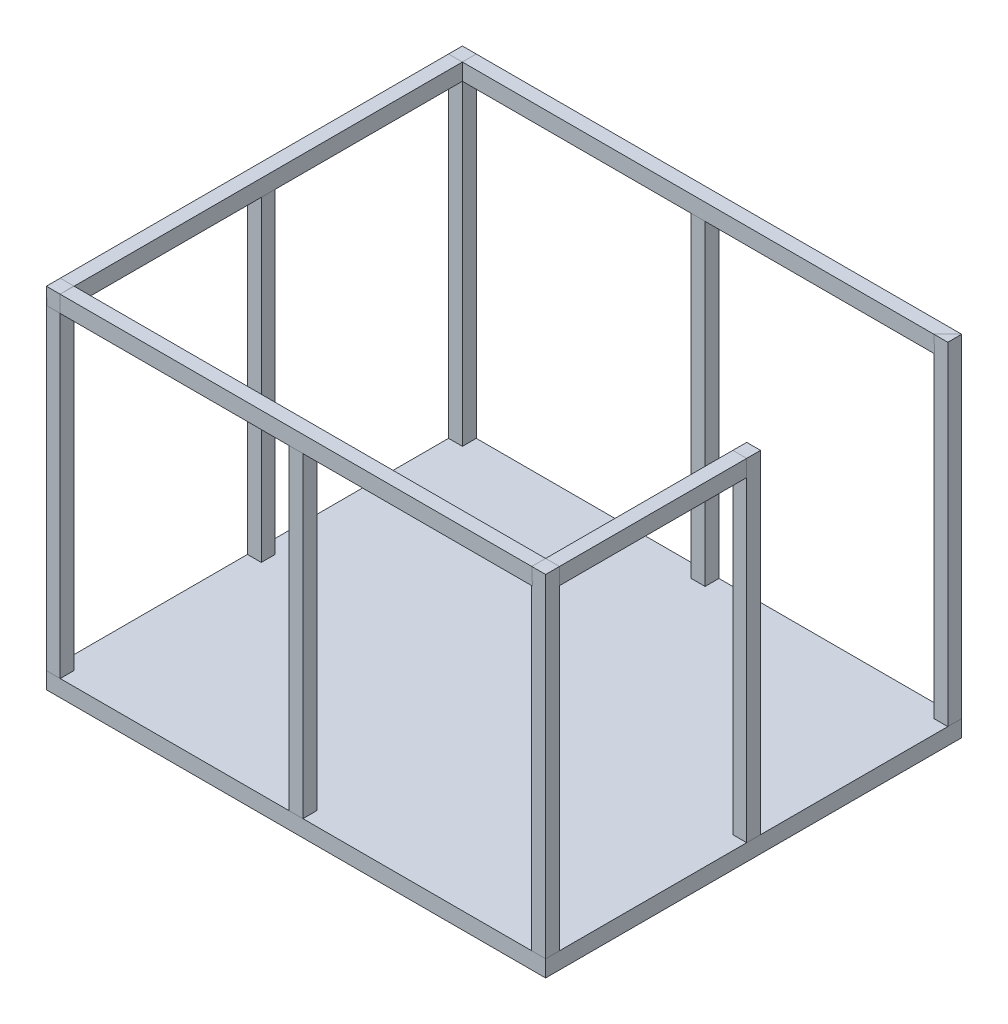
ISO-10303-21;
HEADER;
FILE_DESCRIPTION(('STEP AP214'),'2;1');
FILE_NAME('part.step','',(''),(''),'','','');
FILE_SCHEMA(('AUTOMOTIVE_DESIGN { 1 0 10303 214 1 1 1 1 }'));
ENDSEC;
DATA;
#1=APPLICATION_CONTEXT('core data for automotive mechanical design processes');
#2=APPLICATION_PROTOCOL_DEFINITION('international standard','automotive_design',2000,#1);
#3=PRODUCT_CONTEXT('',#1,'mechanical');
#4=PRODUCT('Part','Part','',(#3));
#5=PRODUCT_RELATED_PRODUCT_CATEGORY('part','',(#4));
#6=PRODUCT_DEFINITION_FORMATION('','',#4);
#7=PRODUCT_DEFINITION_CONTEXT('part definition',#1,'design');
#8=PRODUCT_DEFINITION('design','',#6,#7);
#9=PRODUCT_DEFINITION_SHAPE('','',#8);
#10=(LENGTH_UNIT() NAMED_UNIT(*) SI_UNIT(.MILLI.,.METRE.));
#11=(NAMED_UNIT(*) PLANE_ANGLE_UNIT() SI_UNIT($,.RADIAN.));
#12=(NAMED_UNIT(*) SI_UNIT($,.STERADIAN.) SOLID_ANGLE_UNIT());
#13=UNCERTAINTY_MEASURE_WITH_UNIT(LENGTH_MEASURE(1.E-05),#10,'distance_accuracy_value','');
#14=(GEOMETRIC_REPRESENTATION_CONTEXT(3) GLOBAL_UNCERTAINTY_ASSIGNED_CONTEXT((#13)) GLOBAL_UNIT_ASSIGNED_CONTEXT((#10,
#11,#12)) REPRESENTATION_CONTEXT('',''));
#15=CARTESIAN_POINT('',(0.,0.,0.));
#16=DIRECTION('',(0.,0.,1.));
#17=DIRECTION('',(1.,0.,0.));
#18=AXIS2_PLACEMENT_3D('',#15,#16,#17);
#19=CARTESIAN_POINT('',(900.,1260.,25.));
#20=DIRECTION('',(0.,0.,-1.));
#21=DIRECTION('',(-1.,0.,0.));
#22=AXIS2_PLACEMENT_3D('',#19,#20,#21);
#23=PLANE('',#22);
#24=DIRECTION('',(0.,1.,0.));
#25=VECTOR('',#24,1.);
#26=CARTESIAN_POINT('',(900.,1260.,25.));
#27=LINE('',#26,#25);
#28=CARTESIAN_POINT('',(900.,1200.,25.));
#29=VERTEX_POINT('',#28);
#30=CARTESIAN_POINT('',(900.,1260.,25.));
#31=VERTEX_POINT('',#30);
#32=EDGE_CURVE('E60',#29,#31,#27,.T.);
#33=ORIENTED_EDGE('',*,*,#32,.F.);
#34=DIRECTION('',(1.,0.,0.));
#35=VECTOR('',#34,1.);
#36=CARTESIAN_POINT('',(900.,1200.,25.));
#37=LINE('',#36,#35);
#38=CARTESIAN_POINT('',(850.,1200.,25.));
#39=VERTEX_POINT('',#38);
#40=EDGE_CURVE('E83',#39,#29,#37,.T.);
#41=ORIENTED_EDGE('',*,*,#40,.F.);
#42=DIRECTION('',(0.,-1.,0.));
#43=VECTOR('',#42,1.);
#44=CARTESIAN_POINT('',(850.,1260.,25.));
#45=LINE('',#44,#43);
#46=CARTESIAN_POINT('',(850.,1260.,25.));
#47=VERTEX_POINT('',#46);
#48=EDGE_CURVE('E88',#47,#39,#45,.T.);
#49=ORIENTED_EDGE('',*,*,#48,.F.);
#50=DIRECTION('',(-1.,0.,0.));
#51=VECTOR('',#50,1.);
#52=CARTESIAN_POINT('',(900.,1260.,25.));
#53=LINE('',#52,#51);
#54=EDGE_CURVE('E103',#31,#47,#53,.T.);
#55=ORIENTED_EDGE('',*,*,#54,.F.);
#56=EDGE_LOOP('',(#33,#41,#49,#55));
#57=FACE_BOUND('',#56,.T.);
#58=ADVANCED_FACE('F52',(#57),#23,.T.);
#59=CARTESIAN_POINT('',(0.,0.,750.));
#60=DIRECTION('',(0.,0.,-1.));
#61=DIRECTION('',(-1.,0.,0.));
#62=AXIS2_PLACEMENT_3D('',#59,#60,#61);
#63=PLANE('',#62);
#64=DIRECTION('',(0.,1.,0.));
#65=VECTOR('',#64,1.);
#66=CARTESIAN_POINT('',(900.,1260.,750.));
#67=LINE('',#66,#65);
#68=CARTESIAN_POINT('',(900.,1200.,750.));
#69=VERTEX_POINT('',#68);
#70=CARTESIAN_POINT('',(900.,1260.,750.));
#71=VERTEX_POINT('',#70);
#72=EDGE_CURVE('E112',#69,#71,#67,.T.);
#73=ORIENTED_EDGE('',*,*,#72,.T.);
#74=DIRECTION('',(-1.,0.,0.));
#75=VECTOR('',#74,1.);
#76=CARTESIAN_POINT('',(900.,1260.,750.));
#77=LINE('',#76,#75);
#78=CARTESIAN_POINT('',(850.,1260.,750.));
#79=VERTEX_POINT('',#78);
#80=EDGE_CURVE('E101',#71,#79,#77,.T.);
#81=ORIENTED_EDGE('',*,*,#80,.T.);
#82=DIRECTION('',(0.,-1.,0.));
#83=VECTOR('',#82,1.);
#84=CARTESIAN_POINT('',(850.,1260.,750.));
#85=LINE('',#84,#83);
#86=CARTESIAN_POINT('',(850.,1200.,750.));
#87=VERTEX_POINT('',#86);
#88=EDGE_CURVE('E104',#79,#87,#85,.T.);
#89=ORIENTED_EDGE('',*,*,#88,.T.);
#90=DIRECTION('',(1.,0.,0.));
#91=VECTOR('',#90,1.);
#92=CARTESIAN_POINT('',(900.,1200.,750.));
#93=LINE('',#92,#91);
#94=EDGE_CURVE('E109',#87,#69,#93,.T.);
#95=ORIENTED_EDGE('',*,*,#94,.T.);
#96=EDGE_LOOP('',(#73,#81,#89,#95));
#97=FACE_BOUND('',#96,.T.);
#98=ADVANCED_FACE('F111',(#97),#63,.F.);
#99=CARTESIAN_POINT('',(900.,1260.,-53.1024967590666));
#100=DIRECTION('',(0.,1.,0.));
#101=DIRECTION('',(0.,0.,1.));
#102=AXIS2_PLACEMENT_3D('',#99,#100,#101);
#103=PLANE('',#102);
#104=DIRECTION('',(0.,0.,1.));
#105=VECTOR('',#104,1.);
#106=CARTESIAN_POINT('',(900.,1260.,-53.1024967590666));
#107=LINE('',#106,#105);
#108=EDGE_CURVE('E12',#31,#71,#107,.T.);
#109=ORIENTED_EDGE('',*,*,#108,.F.);
#110=ORIENTED_EDGE('',*,*,#54,.T.);
#111=DIRECTION('',(0.,0.,1.));
#112=VECTOR('',#111,1.);
#113=CARTESIAN_POINT('',(850.,1260.,-53.1024967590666));
#114=LINE('',#113,#112);
#115=EDGE_CURVE('E98',#47,#79,#114,.T.);
#116=ORIENTED_EDGE('',*,*,#115,.T.);
#117=ORIENTED_EDGE('',*,*,#80,.F.);
#118=EDGE_LOOP('',(#109,#110,#116,#117));
#119=FACE_BOUND('',#118,.T.);
#120=ADVANCED_FACE('F99',(#119),#103,.T.);
#121=CARTESIAN_POINT('',(850.,1260.,-53.1024967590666));
#122=DIRECTION('',(-1.,0.,0.));
#123=DIRECTION('',(0.,0.,1.));
#124=AXIS2_PLACEMENT_3D('',#121,#122,#123);
#125=PLANE('',#124);
#126=ORIENTED_EDGE('',*,*,#115,.F.);
#127=ORIENTED_EDGE('',*,*,#48,.T.);
#128=DIRECTION('',(0.,0.,1.));
#129=VECTOR('',#128,1.);
#130=CARTESIAN_POINT('',(850.,1200.,-53.1024967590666));
#131=LINE('',#130,#129);
#132=EDGE_CURVE('E93',#39,#87,#131,.T.);
#133=ORIENTED_EDGE('',*,*,#132,.T.);
#134=ORIENTED_EDGE('',*,*,#88,.F.);
#135=EDGE_LOOP('',(#126,#127,#133,#134));
#136=FACE_BOUND('',#135,.T.);
#137=ADVANCED_FACE('F105',(#136),#125,.T.);
#138=CARTESIAN_POINT('',(900.,1200.,-53.1024967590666));
#139=DIRECTION('',(0.,-1.,0.));
#140=DIRECTION('',(0.,0.,-1.));
#141=AXIS2_PLACEMENT_3D('',#138,#139,#140);
#142=PLANE('',#141);
#143=ORIENTED_EDGE('',*,*,#132,.F.);
#144=ORIENTED_EDGE('',*,*,#40,.T.);
#145=DIRECTION('',(0.,0.,1.));
#146=VECTOR('',#145,1.);
#147=CARTESIAN_POINT('',(900.,1200.,-53.1024967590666));
#148=LINE('',#147,#146);
#149=EDGE_CURVE('E119',#29,#69,#148,.T.);
#150=ORIENTED_EDGE('',*,*,#149,.T.);
#151=ORIENTED_EDGE('',*,*,#94,.F.);
#152=EDGE_LOOP('',(#143,#144,#150,#151));
#153=FACE_BOUND('',#152,.T.);
#154=ADVANCED_FACE('F125',(#153),#142,.T.);
#155=CARTESIAN_POINT('',(900.,1260.,-53.1024967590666));
#156=DIRECTION('',(1.,0.,0.));
#157=DIRECTION('',(0.,0.,-1.));
#158=AXIS2_PLACEMENT_3D('',#155,#156,#157);
#159=PLANE('',#158);
#160=ORIENTED_EDGE('',*,*,#149,.F.);
#161=ORIENTED_EDGE('',*,*,#32,.T.);
#162=ORIENTED_EDGE('',*,*,#108,.T.);
#163=ORIENTED_EDGE('',*,*,#72,.F.);
#164=EDGE_LOOP('',(#160,#161,#162,#163));
#165=FACE_BOUND('',#164,.T.);
#166=ADVANCED_FACE('F126',(#165),#159,.T.);
#167=CLOSED_SHELL('',(#58,#98,#120,#137,#154,#166));
#168=MANIFOLD_SOLID_BREP('B2',#167);
#169=CARTESIAN_POINT('',(-900.,1260.,-699.999999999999));
#170=DIRECTION('',(0.,0.,-1.));
#171=DIRECTION('',(-1.,0.,0.));
#172=AXIS2_PLACEMENT_3D('',#169,#170,#171);
#173=PLANE('',#172);
#174=DIRECTION('',(0.,-1.,0.));
#175=VECTOR('',#174,1.);
#176=CARTESIAN_POINT('',(-900.,1260.,-699.999999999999));
#177=LINE('',#176,#175);
#178=CARTESIAN_POINT('',(-900.,1260.,-699.999999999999));
#179=VERTEX_POINT('',#178);
#180=CARTESIAN_POINT('',(-900.,1200.,-699.999999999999));
#181=VERTEX_POINT('',#180);
#182=EDGE_CURVE('E194',#179,#181,#177,.T.);
#183=ORIENTED_EDGE('',*,*,#182,.F.);
#184=DIRECTION('',(-1.,0.,0.));
#185=VECTOR('',#184,1.);
#186=CARTESIAN_POINT('',(-899.999999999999,1260.,-699.999999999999));
#187=LINE('',#186,#185);
#188=CARTESIAN_POINT('',(-850.,1260.,-700.));
#189=VERTEX_POINT('',#188);
#190=EDGE_CURVE('E217',#189,#179,#187,.T.);
#191=ORIENTED_EDGE('',*,*,#190,.F.);
#192=DIRECTION('',(0.,1.,0.));
#193=VECTOR('',#192,1.);
#194=CARTESIAN_POINT('',(-850.,1260.,-700.));
#195=LINE('',#194,#193);
#196=CARTESIAN_POINT('',(-850.,1200.,-700.));
#197=VERTEX_POINT('',#196);
#198=EDGE_CURVE('E222',#197,#189,#195,.T.);
#199=ORIENTED_EDGE('',*,*,#198,.F.);
#200=DIRECTION('',(1.,0.,0.));
#201=VECTOR('',#200,1.);
#202=CARTESIAN_POINT('',(-899.999999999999,1200.,-699.999999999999));
#203=LINE('',#202,#201);
#204=EDGE_CURVE('E237',#181,#197,#203,.T.);
#205=ORIENTED_EDGE('',*,*,#204,.F.);
#206=EDGE_LOOP('',(#183,#191,#199,#205));
#207=FACE_BOUND('',#206,.T.);
#208=ADVANCED_FACE('F186',(#207),#173,.T.);
#209=CARTESIAN_POINT('',(0.,0.,750.));
#210=DIRECTION('',(0.,0.,1.));
#211=DIRECTION('',(1.,0.,0.));
#212=AXIS2_PLACEMENT_3D('',#209,#210,#211);
#213=PLANE('',#212);
#214=DIRECTION('',(0.,-1.,0.));
#215=VECTOR('',#214,1.);
#216=CARTESIAN_POINT('',(-900.,1260.,750.));
#217=LINE('',#216,#215);
#218=CARTESIAN_POINT('',(-900.,1260.,750.));
#219=VERTEX_POINT('',#218);
#220=CARTESIAN_POINT('',(-900.,1200.,750.));
#221=VERTEX_POINT('',#220);
#222=EDGE_CURVE('E246',#219,#221,#217,.T.);
#223=ORIENTED_EDGE('',*,*,#222,.T.);
#224=DIRECTION('',(1.,0.,0.));
#225=VECTOR('',#224,1.);
#226=CARTESIAN_POINT('',(-900.,1200.,750.));
#227=LINE('',#226,#225);
#228=CARTESIAN_POINT('',(-850.,1200.,750.));
#229=VERTEX_POINT('',#228);
#230=EDGE_CURVE('E235',#221,#229,#227,.T.);
#231=ORIENTED_EDGE('',*,*,#230,.T.);
#232=DIRECTION('',(0.,1.,0.));
#233=VECTOR('',#232,1.);
#234=CARTESIAN_POINT('',(-850.,1260.,750.));
#235=LINE('',#234,#233);
#236=CARTESIAN_POINT('',(-850.,1260.,750.));
#237=VERTEX_POINT('',#236);
#238=EDGE_CURVE('E238',#229,#237,#235,.T.);
#239=ORIENTED_EDGE('',*,*,#238,.T.);
#240=DIRECTION('',(-1.,0.,0.));
#241=VECTOR('',#240,1.);
#242=CARTESIAN_POINT('',(-900.,1260.,750.));
#243=LINE('',#242,#241);
#244=EDGE_CURVE('E243',#237,#219,#243,.T.);
#245=ORIENTED_EDGE('',*,*,#244,.T.);
#246=EDGE_LOOP('',(#223,#231,#239,#245));
#247=FACE_BOUND('',#246,.T.);
#248=ADVANCED_FACE('F245',(#247),#213,.T.);
#249=CARTESIAN_POINT('',(-900.,1200.,-778.102496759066));
#250=DIRECTION('',(0.,-1.,0.));
#251=DIRECTION('',(0.,0.,-1.));
#252=AXIS2_PLACEMENT_3D('',#249,#250,#251);
#253=PLANE('',#252);
#254=DIRECTION('',(0.,0.,1.));
#255=VECTOR('',#254,1.);
#256=CARTESIAN_POINT('',(-900.,1200.,-778.102496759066));
#257=LINE('',#256,#255);
#258=EDGE_CURVE('E50',#181,#221,#257,.T.);
#259=ORIENTED_EDGE('',*,*,#258,.F.);
#260=ORIENTED_EDGE('',*,*,#204,.T.);
#261=DIRECTION('',(0.,0.,1.));
#262=VECTOR('',#261,1.);
#263=CARTESIAN_POINT('',(-850.,1200.,-778.102496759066));
#264=LINE('',#263,#262);
#265=EDGE_CURVE('E232',#197,#229,#264,.T.);
#266=ORIENTED_EDGE('',*,*,#265,.T.);
#267=ORIENTED_EDGE('',*,*,#230,.F.);
#268=EDGE_LOOP('',(#259,#260,#266,#267));
#269=FACE_BOUND('',#268,.T.);
#270=ADVANCED_FACE('F233',(#269),#253,.T.);
#271=CARTESIAN_POINT('',(-850.,1260.,-778.102496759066));
#272=DIRECTION('',(1.,0.,0.));
#273=DIRECTION('',(0.,0.,-1.));
#274=AXIS2_PLACEMENT_3D('',#271,#272,#273);
#275=PLANE('',#274);
#276=ORIENTED_EDGE('',*,*,#265,.F.);
#277=ORIENTED_EDGE('',*,*,#198,.T.);
#278=DIRECTION('',(0.,0.,1.));
#279=VECTOR('',#278,1.);
#280=CARTESIAN_POINT('',(-850.,1260.,-778.102496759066));
#281=LINE('',#280,#279);
#282=EDGE_CURVE('E227',#189,#237,#281,.T.);
#283=ORIENTED_EDGE('',*,*,#282,.T.);
#284=ORIENTED_EDGE('',*,*,#238,.F.);
#285=EDGE_LOOP('',(#276,#277,#283,#284));
#286=FACE_BOUND('',#285,.T.);
#287=ADVANCED_FACE('F239',(#286),#275,.T.);
#288=CARTESIAN_POINT('',(-900.,1260.,-778.102496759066));
#289=DIRECTION('',(0.,1.,0.));
#290=DIRECTION('',(0.,0.,1.));
#291=AXIS2_PLACEMENT_3D('',#288,#289,#290);
#292=PLANE('',#291);
#293=ORIENTED_EDGE('',*,*,#282,.F.);
#294=ORIENTED_EDGE('',*,*,#190,.T.);
#295=DIRECTION('',(0.,0.,1.));
#296=VECTOR('',#295,1.);
#297=CARTESIAN_POINT('',(-900.,1260.,-778.102496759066));
#298=LINE('',#297,#296);
#299=EDGE_CURVE('E253',#179,#219,#298,.T.);
#300=ORIENTED_EDGE('',*,*,#299,.T.);
#301=ORIENTED_EDGE('',*,*,#244,.F.);
#302=EDGE_LOOP('',(#293,#294,#300,#301));
#303=FACE_BOUND('',#302,.T.);
#304=ADVANCED_FACE('F259',(#303),#292,.T.);
#305=CARTESIAN_POINT('',(-900.,1260.,-778.102496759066));
#306=DIRECTION('',(-1.,0.,0.));
#307=DIRECTION('',(0.,0.,1.));
#308=AXIS2_PLACEMENT_3D('',#305,#306,#307);
#309=PLANE('',#308);
#310=ORIENTED_EDGE('',*,*,#299,.F.);
#311=ORIENTED_EDGE('',*,*,#182,.T.);
#312=ORIENTED_EDGE('',*,*,#258,.T.);
#313=ORIENTED_EDGE('',*,*,#222,.F.);
#314=EDGE_LOOP('',(#310,#311,#312,#313));
#315=FACE_BOUND('',#314,.T.);
#316=ADVANCED_FACE('F260',(#315),#309,.T.);
#317=CLOSED_SHELL('',(#208,#248,#270,#287,#304,#316));
#318=MANIFOLD_SOLID_BREP('B6',#317);
#319=CARTESIAN_POINT('',(-850.,1260.,750.));
#320=DIRECTION('',(-1.,0.,0.));
#321=DIRECTION('',(0.,0.,1.));
#322=AXIS2_PLACEMENT_3D('',#319,#320,#321);
#323=PLANE('',#322);
#324=DIRECTION('',(0.,-1.,0.));
#325=VECTOR('',#324,1.);
#326=CARTESIAN_POINT('',(-850.,1260.,-699.999999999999));
#327=LINE('',#326,#325);
#328=CARTESIAN_POINT('',(-850.,1260.,-699.999999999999));
#329=VERTEX_POINT('',#328);
#330=CARTESIAN_POINT('',(-850.,1200.,-699.999999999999));
#331=VERTEX_POINT('',#330);
#332=EDGE_CURVE('E339',#329,#331,#327,.T.);
#333=ORIENTED_EDGE('',*,*,#332,.F.);
#334=DIRECTION('',(0.,0.,1.));
#335=VECTOR('',#334,1.);
#336=CARTESIAN_POINT('',(-850.,1260.,-699.999999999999));
#337=LINE('',#336,#335);
#338=CARTESIAN_POINT('',(-850.,1260.,-750.));
#339=VERTEX_POINT('',#338);
#340=EDGE_CURVE('E363',#339,#329,#337,.T.);
#341=ORIENTED_EDGE('',*,*,#340,.F.);
#342=DIRECTION('',(0.,1.,0.));
#343=VECTOR('',#342,1.);
#344=CARTESIAN_POINT('',(-850.,1260.,-750.));
#345=LINE('',#344,#343);
#346=CARTESIAN_POINT('',(-850.,1200.,-750.));
#347=VERTEX_POINT('',#346);
#348=EDGE_CURVE('E380',#347,#339,#345,.T.);
#349=ORIENTED_EDGE('',*,*,#348,.F.);
#350=DIRECTION('',(0.,0.,-1.));
#351=VECTOR('',#350,1.);
#352=CARTESIAN_POINT('',(-850.,1200.,-699.999999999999));
#353=LINE('',#352,#351);
#354=EDGE_CURVE('E375',#331,#347,#353,.T.);
#355=ORIENTED_EDGE('',*,*,#354,.F.);
#356=EDGE_LOOP('',(#333,#341,#349,#355));
#357=FACE_BOUND('',#356,.T.);
#358=ADVANCED_FACE('F320',(#357),#323,.T.);
#359=CARTESIAN_POINT('',(900.,0.,0.));
#360=DIRECTION('',(1.,0.,0.));
#361=DIRECTION('',(0.,0.,-1.));
#362=AXIS2_PLACEMENT_3D('',#359,#360,#361);
#363=PLANE('',#362);
#364=DIRECTION('',(0.,-1.,0.));
#365=VECTOR('',#364,1.);
#366=CARTESIAN_POINT('',(900.,1260.,-699.999999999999));
#367=LINE('',#366,#365);
#368=CARTESIAN_POINT('',(900.,1260.,-699.999999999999));
#369=VERTEX_POINT('',#368);
#370=CARTESIAN_POINT('',(900.,1200.,-699.999999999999));
#371=VERTEX_POINT('',#370);
#372=EDGE_CURVE('E184',#369,#371,#367,.T.);
#373=ORIENTED_EDGE('',*,*,#372,.T.);
#374=DIRECTION('',(0.,0.,-1.));
#375=VECTOR('',#374,1.);
#376=CARTESIAN_POINT('',(900.,1200.,-699.999999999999));
#377=LINE('',#376,#375);
#378=CARTESIAN_POINT('',(900.,1200.,-750.));
#379=VERTEX_POINT('',#378);
#380=EDGE_CURVE('E330',#371,#379,#377,.T.);
#381=ORIENTED_EDGE('',*,*,#380,.T.);
#382=DIRECTION('',(0.,1.,0.));
#383=VECTOR('',#382,1.);
#384=CARTESIAN_POINT('',(900.,1260.,-750.));
#385=LINE('',#384,#383);
#386=CARTESIAN_POINT('',(900.,1260.,-750.));
#387=VERTEX_POINT('',#386);
#388=EDGE_CURVE('E374',#379,#387,#385,.T.);
#389=ORIENTED_EDGE('',*,*,#388,.T.);
#390=DIRECTION('',(0.,0.,1.));
#391=VECTOR('',#390,1.);
#392=CARTESIAN_POINT('',(900.,1260.,-699.999999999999));
#393=LINE('',#392,#391);
#394=EDGE_CURVE('E324',#387,#369,#393,.T.);
#395=ORIENTED_EDGE('',*,*,#394,.T.);
#396=EDGE_LOOP('',(#373,#381,#389,#395));
#397=FACE_BOUND('',#396,.T.);
#398=ADVANCED_FACE('F322',(#397),#363,.T.);
#399=CARTESIAN_POINT('',(-928.102496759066,1200.,-699.999999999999));
#400=DIRECTION('',(0.,-1.,0.));
#401=DIRECTION('',(0.,0.,-1.));
#402=AXIS2_PLACEMENT_3D('',#399,#400,#401);
#403=PLANE('',#402);
#404=DIRECTION('',(1.,0.,0.));
#405=VECTOR('',#404,1.);
#406=CARTESIAN_POINT('',(-928.102496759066,1200.,-699.999999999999));
#407=LINE('',#406,#405);
#408=EDGE_CURVE('E368',#331,#371,#407,.T.);
#409=ORIENTED_EDGE('',*,*,#408,.F.);
#410=ORIENTED_EDGE('',*,*,#354,.T.);
#411=DIRECTION('',(1.,0.,0.));
#412=VECTOR('',#411,1.);
#413=CARTESIAN_POINT('',(-928.102496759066,1200.,-750.));
#414=LINE('',#413,#412);
#415=EDGE_CURVE('E377',#347,#379,#414,.T.);
#416=ORIENTED_EDGE('',*,*,#415,.T.);
#417=ORIENTED_EDGE('',*,*,#380,.F.);
#418=EDGE_LOOP('',(#409,#410,#416,#417));
#419=FACE_BOUND('',#418,.T.);
#420=ADVANCED_FACE('F385',(#419),#403,.T.);
#421=CARTESIAN_POINT('',(-928.102496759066,1260.,-750.));
#422=DIRECTION('',(0.,0.,-1.));
#423=DIRECTION('',(-1.,0.,0.));
#424=AXIS2_PLACEMENT_3D('',#421,#422,#423);
#425=PLANE('',#424);
#426=ORIENTED_EDGE('',*,*,#415,.F.);
#427=ORIENTED_EDGE('',*,*,#348,.T.);
#428=DIRECTION('',(1.,0.,0.));
#429=VECTOR('',#428,1.);
#430=CARTESIAN_POINT('',(-928.102496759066,1260.,-750.));
#431=LINE('',#430,#429);
#432=EDGE_CURVE('E390',#339,#387,#431,.T.);
#433=ORIENTED_EDGE('',*,*,#432,.T.);
#434=ORIENTED_EDGE('',*,*,#388,.F.);
#435=EDGE_LOOP('',(#426,#427,#433,#434));
#436=FACE_BOUND('',#435,.T.);
#437=ADVANCED_FACE('F389',(#436),#425,.T.);
#438=CARTESIAN_POINT('',(-928.102496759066,1260.,-699.999999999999));
#439=DIRECTION('',(0.,1.,0.));
#440=DIRECTION('',(0.,0.,1.));
#441=AXIS2_PLACEMENT_3D('',#438,#439,#440);
#442=PLANE('',#441);
#443=ORIENTED_EDGE('',*,*,#432,.F.);
#444=ORIENTED_EDGE('',*,*,#340,.T.);
#445=DIRECTION('',(1.,0.,0.));
#446=VECTOR('',#445,1.);
#447=CARTESIAN_POINT('',(-928.102496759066,1260.,-699.999999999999));
#448=LINE('',#447,#446);
#449=EDGE_CURVE('E358',#329,#369,#448,.T.);
#450=ORIENTED_EDGE('',*,*,#449,.T.);
#451=ORIENTED_EDGE('',*,*,#394,.F.);
#452=EDGE_LOOP('',(#443,#444,#450,#451));
#453=FACE_BOUND('',#452,.T.);
#454=ADVANCED_FACE('F361',(#453),#442,.T.);
#455=CARTESIAN_POINT('',(-928.102496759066,1260.,-699.999999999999));
#456=DIRECTION('',(0.,0.,1.));
#457=DIRECTION('',(1.,0.,0.));
#458=AXIS2_PLACEMENT_3D('',#455,#456,#457);
#459=PLANE('',#458);
#460=ORIENTED_EDGE('',*,*,#449,.F.);
#461=ORIENTED_EDGE('',*,*,#332,.T.);
#462=ORIENTED_EDGE('',*,*,#408,.T.);
#463=ORIENTED_EDGE('',*,*,#372,.F.);
#464=EDGE_LOOP('',(#460,#461,#462,#463));
#465=FACE_BOUND('',#464,.T.);
#466=ADVANCED_FACE('F366',(#465),#459,.T.);
#467=CLOSED_SHELL('',(#358,#398,#420,#437,#454,#466));
#468=MANIFOLD_SOLID_BREP('B44',#467);
#469=CARTESIAN_POINT('',(-850.,1260.,750.));
#470=DIRECTION('',(-1.,0.,0.));
#471=DIRECTION('',(0.,0.,1.));
#472=AXIS2_PLACEMENT_3D('',#469,#470,#471);
#473=PLANE('',#472);
#474=DIRECTION('',(0.,-1.,0.));
#475=VECTOR('',#474,1.);
#476=CARTESIAN_POINT('',(-850.,1260.,750.));
#477=LINE('',#476,#475);
#478=CARTESIAN_POINT('',(-850.,1260.,750.));
#479=VERTEX_POINT('',#478);
#480=CARTESIAN_POINT('',(-850.,1200.,750.));
#481=VERTEX_POINT('',#480);
#482=EDGE_CURVE('E462',#479,#481,#477,.T.);
#483=ORIENTED_EDGE('',*,*,#482,.F.);
#484=DIRECTION('',(0.,0.,1.));
#485=VECTOR('',#484,1.);
#486=CARTESIAN_POINT('',(-850.,1260.,750.));
#487=LINE('',#486,#485);
#488=CARTESIAN_POINT('',(-850.,1260.,700.));
#489=VERTEX_POINT('',#488);
#490=EDGE_CURVE('E485',#489,#479,#487,.T.);
#491=ORIENTED_EDGE('',*,*,#490,.F.);
#492=DIRECTION('',(0.,1.,0.));
#493=VECTOR('',#492,1.);
#494=CARTESIAN_POINT('',(-850.,1260.,700.));
#495=LINE('',#494,#493);
#496=CARTESIAN_POINT('',(-850.,1200.,700.));
#497=VERTEX_POINT('',#496);
#498=EDGE_CURVE('E490',#497,#489,#495,.T.);
#499=ORIENTED_EDGE('',*,*,#498,.F.);
#500=DIRECTION('',(0.,0.,-1.));
#501=VECTOR('',#500,1.);
#502=CARTESIAN_POINT('',(-850.,1200.,750.));
#503=LINE('',#502,#501);
#504=EDGE_CURVE('E505',#481,#497,#503,.T.);
#505=ORIENTED_EDGE('',*,*,#504,.F.);
#506=EDGE_LOOP('',(#483,#491,#499,#505));
#507=FACE_BOUND('',#506,.T.);
#508=ADVANCED_FACE('F454',(#507),#473,.T.);
#509=CARTESIAN_POINT('',(900.,0.,0.));
#510=DIRECTION('',(1.,0.,0.));
#511=DIRECTION('',(0.,0.,-1.));
#512=AXIS2_PLACEMENT_3D('',#509,#510,#511);
#513=PLANE('',#512);
#514=DIRECTION('',(0.,-1.,0.));
#515=VECTOR('',#514,1.);
#516=CARTESIAN_POINT('',(900.,1260.,750.));
#517=LINE('',#516,#515);
#518=CARTESIAN_POINT('',(900.,1260.,750.));
#519=VERTEX_POINT('',#518);
#520=CARTESIAN_POINT('',(900.,1200.,750.));
#521=VERTEX_POINT('',#520);
#522=EDGE_CURVE('E514',#519,#521,#517,.T.);
#523=ORIENTED_EDGE('',*,*,#522,.T.);
#524=DIRECTION('',(0.,0.,-1.));
#525=VECTOR('',#524,1.);
#526=CARTESIAN_POINT('',(900.,1200.,750.));
#527=LINE('',#526,#525);
#528=CARTESIAN_POINT('',(900.,1200.,700.));
#529=VERTEX_POINT('',#528);
#530=EDGE_CURVE('E503',#521,#529,#527,.T.);
#531=ORIENTED_EDGE('',*,*,#530,.T.);
#532=DIRECTION('',(0.,1.,0.));
#533=VECTOR('',#532,1.);
#534=CARTESIAN_POINT('',(900.,1260.,700.));
#535=LINE('',#534,#533);
#536=CARTESIAN_POINT('',(900.,1260.,700.));
#537=VERTEX_POINT('',#536);
#538=EDGE_CURVE('E506',#529,#537,#535,.T.);
#539=ORIENTED_EDGE('',*,*,#538,.T.);
#540=DIRECTION('',(0.,0.,1.));
#541=VECTOR('',#540,1.);
#542=CARTESIAN_POINT('',(900.,1260.,750.));
#543=LINE('',#542,#541);
#544=EDGE_CURVE('E511',#537,#519,#543,.T.);
#545=ORIENTED_EDGE('',*,*,#544,.T.);
#546=EDGE_LOOP('',(#523,#531,#539,#545));
#547=FACE_BOUND('',#546,.T.);
#548=ADVANCED_FACE('F513',(#547),#513,.T.);
#549=CARTESIAN_POINT('',(-928.102496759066,1200.,750.));
#550=DIRECTION('',(0.,-1.,0.));
#551=DIRECTION('',(0.,0.,-1.));
#552=AXIS2_PLACEMENT_3D('',#549,#550,#551);
#553=PLANE('',#552);
#554=DIRECTION('',(1.,0.,0.));
#555=VECTOR('',#554,1.);
#556=CARTESIAN_POINT('',(-928.102496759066,1200.,750.));
#557=LINE('',#556,#555);
#558=EDGE_CURVE('E318',#481,#521,#557,.T.);
#559=ORIENTED_EDGE('',*,*,#558,.F.);
#560=ORIENTED_EDGE('',*,*,#504,.T.);
#561=DIRECTION('',(1.,0.,0.));
#562=VECTOR('',#561,1.);
#563=CARTESIAN_POINT('',(-928.102496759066,1200.,700.));
#564=LINE('',#563,#562);
#565=EDGE_CURVE('E500',#497,#529,#564,.T.);
#566=ORIENTED_EDGE('',*,*,#565,.T.);
#567=ORIENTED_EDGE('',*,*,#530,.F.);
#568=EDGE_LOOP('',(#559,#560,#566,#567));
#569=FACE_BOUND('',#568,.T.);
#570=ADVANCED_FACE('F501',(#569),#553,.T.);
#571=CARTESIAN_POINT('',(-928.102496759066,1260.,700.));
#572=DIRECTION('',(0.,0.,-1.));
#573=DIRECTION('',(-1.,0.,0.));
#574=AXIS2_PLACEMENT_3D('',#571,#572,#573);
#575=PLANE('',#574);
#576=ORIENTED_EDGE('',*,*,#565,.F.);
#577=ORIENTED_EDGE('',*,*,#498,.T.);
#578=DIRECTION('',(1.,0.,0.));
#579=VECTOR('',#578,1.);
#580=CARTESIAN_POINT('',(-928.102496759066,1260.,700.));
#581=LINE('',#580,#579);
#582=EDGE_CURVE('E495',#489,#537,#581,.T.);
#583=ORIENTED_EDGE('',*,*,#582,.T.);
#584=ORIENTED_EDGE('',*,*,#538,.F.);
#585=EDGE_LOOP('',(#576,#577,#583,#584));
#586=FACE_BOUND('',#585,.T.);
#587=ADVANCED_FACE('F507',(#586),#575,.T.);
#588=CARTESIAN_POINT('',(-928.102496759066,1260.,750.));
#589=DIRECTION('',(0.,1.,0.));
#590=DIRECTION('',(0.,0.,1.));
#591=AXIS2_PLACEMENT_3D('',#588,#589,#590);
#592=PLANE('',#591);
#593=ORIENTED_EDGE('',*,*,#582,.F.);
#594=ORIENTED_EDGE('',*,*,#490,.T.);
#595=DIRECTION('',(1.,0.,0.));
#596=VECTOR('',#595,1.);
#597=CARTESIAN_POINT('',(-928.102496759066,1260.,750.));
#598=LINE('',#597,#596);
#599=EDGE_CURVE('E521',#479,#519,#598,.T.);
#600=ORIENTED_EDGE('',*,*,#599,.T.);
#601=ORIENTED_EDGE('',*,*,#544,.F.);
#602=EDGE_LOOP('',(#593,#594,#600,#601));
#603=FACE_BOUND('',#602,.T.);
#604=ADVANCED_FACE('F527',(#603),#592,.T.);
#605=CARTESIAN_POINT('',(-928.102496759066,1260.,750.));
#606=DIRECTION('',(0.,0.,1.));
#607=DIRECTION('',(1.,0.,0.));
#608=AXIS2_PLACEMENT_3D('',#605,#606,#607);
#609=PLANE('',#608);
#610=ORIENTED_EDGE('',*,*,#599,.F.);
#611=ORIENTED_EDGE('',*,*,#482,.T.);
#612=ORIENTED_EDGE('',*,*,#558,.T.);
#613=ORIENTED_EDGE('',*,*,#522,.F.);
#614=EDGE_LOOP('',(#610,#611,#612,#613));
#615=FACE_BOUND('',#614,.T.);
#616=ADVANCED_FACE('F528',(#615),#609,.T.);
#617=CLOSED_SHELL('',(#508,#548,#570,#587,#604,#616));
#618=MANIFOLD_SOLID_BREP('B178',#617);
#619=CARTESIAN_POINT('',(25.,1260.,-750.));
#620=DIRECTION('',(-1.,0.,0.));
#621=DIRECTION('',(0.,0.,1.));
#622=AXIS2_PLACEMENT_3D('',#619,#620,#621);
#623=PLANE('',#622);
#624=DIRECTION('',(0.,0.,-1.));
#625=VECTOR('',#624,1.);
#626=CARTESIAN_POINT('',(25.,60.,-750.));
#627=LINE('',#626,#625);
#628=CARTESIAN_POINT('',(25.,60.,-700.));
#629=VERTEX_POINT('',#628);
#630=CARTESIAN_POINT('',(25.,60.,-750.));
#631=VERTEX_POINT('',#630);
#632=EDGE_CURVE('E452',#629,#631,#627,.T.);
#633=ORIENTED_EDGE('',*,*,#632,.T.);
#634=DIRECTION('',(0.,-1.,0.));
#635=VECTOR('',#634,1.);
#636=CARTESIAN_POINT('',(25.,1260.,-750.));
#637=LINE('',#636,#635);
#638=CARTESIAN_POINT('',(25.,1260.,-750.));
#639=VERTEX_POINT('',#638);
#640=EDGE_CURVE('E659',#639,#631,#637,.T.);
#641=ORIENTED_EDGE('',*,*,#640,.F.);
#642=DIRECTION('',(0.,0.,-1.));
#643=VECTOR('',#642,1.);
#644=CARTESIAN_POINT('',(25.,1260.,-750.));
#645=LINE('',#644,#643);
#646=CARTESIAN_POINT('',(25.,1260.,-700.));
#647=VERTEX_POINT('',#646);
#648=EDGE_CURVE('E592',#647,#639,#645,.T.);
#649=ORIENTED_EDGE('',*,*,#648,.F.);
#650=DIRECTION('',(0.,-1.,0.));
#651=VECTOR('',#650,1.);
#652=CARTESIAN_POINT('',(25.,1260.,-700.));
#653=LINE('',#652,#651);
#654=EDGE_CURVE('E647',#647,#629,#653,.T.);
#655=ORIENTED_EDGE('',*,*,#654,.T.);
#656=EDGE_LOOP('',(#633,#641,#649,#655));
#657=FACE_BOUND('',#656,.T.);
#658=ADVANCED_FACE('F588',(#657),#623,.F.);
#659=CARTESIAN_POINT('',(25.,1260.,-750.));
#660=DIRECTION('',(0.,0.,1.));
#661=DIRECTION('',(1.,0.,0.));
#662=AXIS2_PLACEMENT_3D('',#659,#660,#661);
#663=PLANE('',#662);
#664=DIRECTION('',(-1.,0.,0.));
#665=VECTOR('',#664,1.);
#666=CARTESIAN_POINT('',(25.,60.,-750.));
#667=LINE('',#666,#665);
#668=CARTESIAN_POINT('',(-25.,60.,-750.));
#669=VERTEX_POINT('',#668);
#670=EDGE_CURVE('E598',#631,#669,#667,.T.);
#671=ORIENTED_EDGE('',*,*,#670,.T.);
#672=DIRECTION('',(0.,-1.,0.));
#673=VECTOR('',#672,1.);
#674=CARTESIAN_POINT('',(-25.,1260.,-750.));
#675=LINE('',#674,#673);
#676=CARTESIAN_POINT('',(-25.,1260.,-750.));
#677=VERTEX_POINT('',#676);
#678=EDGE_CURVE('E643',#677,#669,#675,.T.);
#679=ORIENTED_EDGE('',*,*,#678,.F.);
#680=DIRECTION('',(-1.,0.,0.));
#681=VECTOR('',#680,1.);
#682=CARTESIAN_POINT('',(25.,1260.,-750.));
#683=LINE('',#682,#681);
#684=EDGE_CURVE('E622',#639,#677,#683,.T.);
#685=ORIENTED_EDGE('',*,*,#684,.F.);
#686=ORIENTED_EDGE('',*,*,#640,.T.);
#687=EDGE_LOOP('',(#671,#679,#685,#686));
#688=FACE_BOUND('',#687,.T.);
#689=ADVANCED_FACE('F662',(#688),#663,.F.);
#690=CARTESIAN_POINT('',(-25.,1260.,-750.));
#691=DIRECTION('',(1.,0.,0.));
#692=DIRECTION('',(0.,0.,-1.));
#693=AXIS2_PLACEMENT_3D('',#690,#691,#692);
#694=PLANE('',#693);
#695=DIRECTION('',(0.,0.,1.));
#696=VECTOR('',#695,1.);
#697=CARTESIAN_POINT('',(-25.,60.,-750.));
#698=LINE('',#697,#696);
#699=CARTESIAN_POINT('',(-25.,60.,-700.));
#700=VERTEX_POINT('',#699);
#701=EDGE_CURVE('E638',#669,#700,#698,.T.);
#702=ORIENTED_EDGE('',*,*,#701,.T.);
#703=DIRECTION('',(0.,-1.,0.));
#704=VECTOR('',#703,1.);
#705=CARTESIAN_POINT('',(-25.,1260.,-700.));
#706=LINE('',#705,#704);
#707=CARTESIAN_POINT('',(-25.,1260.,-700.));
#708=VERTEX_POINT('',#707);
#709=EDGE_CURVE('E641',#708,#700,#706,.T.);
#710=ORIENTED_EDGE('',*,*,#709,.F.);
#711=DIRECTION('',(0.,0.,1.));
#712=VECTOR('',#711,1.);
#713=CARTESIAN_POINT('',(-25.,1260.,-750.));
#714=LINE('',#713,#712);
#715=EDGE_CURVE('E655',#677,#708,#714,.T.);
#716=ORIENTED_EDGE('',*,*,#715,.F.);
#717=ORIENTED_EDGE('',*,*,#678,.T.);
#718=EDGE_LOOP('',(#702,#710,#716,#717));
#719=FACE_BOUND('',#718,.T.);
#720=ADVANCED_FACE('F639',(#719),#694,.F.);
#721=CARTESIAN_POINT('',(25.,1260.,-700.));
#722=DIRECTION('',(0.,0.,-1.));
#723=DIRECTION('',(-1.,0.,0.));
#724=AXIS2_PLACEMENT_3D('',#721,#722,#723);
#725=PLANE('',#724);
#726=DIRECTION('',(1.,0.,0.));
#727=VECTOR('',#726,1.);
#728=CARTESIAN_POINT('',(25.,60.,-700.));
#729=LINE('',#728,#727);
#730=EDGE_CURVE('E632',#700,#629,#729,.T.);
#731=ORIENTED_EDGE('',*,*,#730,.T.);
#732=ORIENTED_EDGE('',*,*,#654,.F.);
#733=DIRECTION('',(1.,0.,0.));
#734=VECTOR('',#733,1.);
#735=CARTESIAN_POINT('',(25.,1260.,-700.));
#736=LINE('',#735,#734);
#737=EDGE_CURVE('E646',#708,#647,#736,.T.);
#738=ORIENTED_EDGE('',*,*,#737,.F.);
#739=ORIENTED_EDGE('',*,*,#709,.T.);
#740=EDGE_LOOP('',(#731,#732,#738,#739));
#741=FACE_BOUND('',#740,.T.);
#742=ADVANCED_FACE('F645',(#741),#725,.F.);
#743=CARTESIAN_POINT('',(0.,1260.,0.));
#744=DIRECTION('',(0.,-1.,0.));
#745=DIRECTION('',(0.,0.,-1.));
#746=AXIS2_PLACEMENT_3D('',#743,#744,#745);
#747=PLANE('',#746);
#748=ORIENTED_EDGE('',*,*,#648,.T.);
#749=ORIENTED_EDGE('',*,*,#684,.T.);
#750=ORIENTED_EDGE('',*,*,#715,.T.);
#751=ORIENTED_EDGE('',*,*,#737,.T.);
#752=EDGE_LOOP('',(#748,#749,#750,#751));
#753=FACE_BOUND('',#752,.T.);
#754=ADVANCED_FACE('F590',(#753),#747,.F.);
#755=CARTESIAN_POINT('',(0.,60.,0.));
#756=DIRECTION('',(0.,-1.,0.));
#757=DIRECTION('',(0.,0.,-1.));
#758=AXIS2_PLACEMENT_3D('',#755,#756,#757);
#759=PLANE('',#758);
#760=ORIENTED_EDGE('',*,*,#632,.F.);
#761=ORIENTED_EDGE('',*,*,#730,.F.);
#762=ORIENTED_EDGE('',*,*,#701,.F.);
#763=ORIENTED_EDGE('',*,*,#670,.F.);
#764=EDGE_LOOP('',(#760,#761,#762,#763));
#765=FACE_BOUND('',#764,.T.);
#766=ADVANCED_FACE('F649',(#765),#759,.T.);
#767=CLOSED_SHELL('',(#658,#689,#720,#742,#754,#766));
#768=MANIFOLD_SOLID_BREP('B312',#767);
#769=CARTESIAN_POINT('',(25.0000000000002,1260.,750.));
#770=DIRECTION('',(-1.,0.,0.));
#771=DIRECTION('',(0.,0.,1.));
#772=AXIS2_PLACEMENT_3D('',#769,#770,#771);
#773=PLANE('',#772);
#774=DIRECTION('',(0.,0.,-1.));
#775=VECTOR('',#774,1.);
#776=CARTESIAN_POINT('',(25.0000000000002,60.,750.));
#777=LINE('',#776,#775);
#778=CARTESIAN_POINT('',(25.0000000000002,60.,750.));
#779=VERTEX_POINT('',#778);
#780=CARTESIAN_POINT('',(25.,60.,700.));
#781=VERTEX_POINT('',#780);
#782=EDGE_CURVE('E586',#779,#781,#777,.T.);
#783=ORIENTED_EDGE('',*,*,#782,.T.);
#784=DIRECTION('',(0.,-1.,0.));
#785=VECTOR('',#784,1.);
#786=CARTESIAN_POINT('',(25.,1260.,700.));
#787=LINE('',#786,#785);
#788=CARTESIAN_POINT('',(25.,1260.,700.));
#789=VERTEX_POINT('',#788);
#790=EDGE_CURVE('E793',#789,#781,#787,.T.);
#791=ORIENTED_EDGE('',*,*,#790,.F.);
#792=DIRECTION('',(0.,0.,-1.));
#793=VECTOR('',#792,1.);
#794=CARTESIAN_POINT('',(25.0000000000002,1260.,750.));
#795=LINE('',#794,#793);
#796=CARTESIAN_POINT('',(25.0000000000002,1260.,750.));
#797=VERTEX_POINT('',#796);
#798=EDGE_CURVE('E726',#797,#789,#795,.T.);
#799=ORIENTED_EDGE('',*,*,#798,.F.);
#800=DIRECTION('',(0.,-1.,0.));
#801=VECTOR('',#800,1.);
#802=CARTESIAN_POINT('',(25.0000000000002,1260.,750.));
#803=LINE('',#802,#801);
#804=EDGE_CURVE('E781',#797,#779,#803,.T.);
#805=ORIENTED_EDGE('',*,*,#804,.T.);
#806=EDGE_LOOP('',(#783,#791,#799,#805));
#807=FACE_BOUND('',#806,.T.);
#808=ADVANCED_FACE('F722',(#807),#773,.F.);
#809=CARTESIAN_POINT('',(25.,1260.,700.));
#810=DIRECTION('',(0.,0.,1.));
#811=DIRECTION('',(1.,0.,0.));
#812=AXIS2_PLACEMENT_3D('',#809,#810,#811);
#813=PLANE('',#812);
#814=DIRECTION('',(-1.,0.,0.));
#815=VECTOR('',#814,1.);
#816=CARTESIAN_POINT('',(25.,60.,700.));
#817=LINE('',#816,#815);
#818=CARTESIAN_POINT('',(-25.,60.,700.));
#819=VERTEX_POINT('',#818);
#820=EDGE_CURVE('E732',#781,#819,#817,.T.);
#821=ORIENTED_EDGE('',*,*,#820,.T.);
#822=DIRECTION('',(0.,-1.,0.));
#823=VECTOR('',#822,1.);
#824=CARTESIAN_POINT('',(-25.,1260.,700.));
#825=LINE('',#824,#823);
#826=CARTESIAN_POINT('',(-25.,1260.,700.));
#827=VERTEX_POINT('',#826);
#828=EDGE_CURVE('E777',#827,#819,#825,.T.);
#829=ORIENTED_EDGE('',*,*,#828,.F.);
#830=DIRECTION('',(-1.,0.,0.));
#831=VECTOR('',#830,1.);
#832=CARTESIAN_POINT('',(25.,1260.,700.));
#833=LINE('',#832,#831);
#834=EDGE_CURVE('E756',#789,#827,#833,.T.);
#835=ORIENTED_EDGE('',*,*,#834,.F.);
#836=ORIENTED_EDGE('',*,*,#790,.T.);
#837=EDGE_LOOP('',(#821,#829,#835,#836));
#838=FACE_BOUND('',#837,.T.);
#839=ADVANCED_FACE('F796',(#838),#813,.F.);
#840=CARTESIAN_POINT('',(-25.0000000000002,1260.,750.));
#841=DIRECTION('',(1.,0.,0.));
#842=DIRECTION('',(0.,0.,-1.));
#843=AXIS2_PLACEMENT_3D('',#840,#841,#842);
#844=PLANE('',#843);
#845=DIRECTION('',(0.,0.,1.));
#846=VECTOR('',#845,1.);
#847=CARTESIAN_POINT('',(-25.0000000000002,60.,750.));
#848=LINE('',#847,#846);
#849=CARTESIAN_POINT('',(-25.0000000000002,60.,750.));
#850=VERTEX_POINT('',#849);
#851=EDGE_CURVE('E772',#819,#850,#848,.T.);
#852=ORIENTED_EDGE('',*,*,#851,.T.);
#853=DIRECTION('',(0.,-1.,0.));
#854=VECTOR('',#853,1.);
#855=CARTESIAN_POINT('',(-25.0000000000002,1260.,750.));
#856=LINE('',#855,#854);
#857=CARTESIAN_POINT('',(-25.0000000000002,1260.,750.));
#858=VERTEX_POINT('',#857);
#859=EDGE_CURVE('E775',#858,#850,#856,.T.);
#860=ORIENTED_EDGE('',*,*,#859,.F.);
#861=DIRECTION('',(0.,0.,1.));
#862=VECTOR('',#861,1.);
#863=CARTESIAN_POINT('',(-25.0000000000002,1260.,750.));
#864=LINE('',#863,#862);
#865=EDGE_CURVE('E789',#827,#858,#864,.T.);
#866=ORIENTED_EDGE('',*,*,#865,.F.);
#867=ORIENTED_EDGE('',*,*,#828,.T.);
#868=EDGE_LOOP('',(#852,#860,#866,#867));
#869=FACE_BOUND('',#868,.T.);
#870=ADVANCED_FACE('F773',(#869),#844,.F.);
#871=CARTESIAN_POINT('',(25.0000000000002,1260.,750.));
#872=DIRECTION('',(0.,0.,-1.));
#873=DIRECTION('',(-1.,0.,0.));
#874=AXIS2_PLACEMENT_3D('',#871,#872,#873);
#875=PLANE('',#874);
#876=DIRECTION('',(1.,0.,0.));
#877=VECTOR('',#876,1.);
#878=CARTESIAN_POINT('',(25.0000000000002,60.,750.));
#879=LINE('',#878,#877);
#880=EDGE_CURVE('E766',#850,#779,#879,.T.);
#881=ORIENTED_EDGE('',*,*,#880,.T.);
#882=ORIENTED_EDGE('',*,*,#804,.F.);
#883=DIRECTION('',(1.,0.,0.));
#884=VECTOR('',#883,1.);
#885=CARTESIAN_POINT('',(25.0000000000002,1260.,750.));
#886=LINE('',#885,#884);
#887=EDGE_CURVE('E780',#858,#797,#886,.T.);
#888=ORIENTED_EDGE('',*,*,#887,.F.);
#889=ORIENTED_EDGE('',*,*,#859,.T.);
#890=EDGE_LOOP('',(#881,#882,#888,#889));
#891=FACE_BOUND('',#890,.T.);
#892=ADVANCED_FACE('F779',(#891),#875,.F.);
#893=CARTESIAN_POINT('',(0.,1260.,0.));
#894=DIRECTION('',(0.,1.,0.));
#895=DIRECTION('',(0.,0.,1.));
#896=AXIS2_PLACEMENT_3D('',#893,#894,#895);
#897=PLANE('',#896);
#898=ORIENTED_EDGE('',*,*,#798,.T.);
#899=ORIENTED_EDGE('',*,*,#834,.T.);
#900=ORIENTED_EDGE('',*,*,#865,.T.);
#901=ORIENTED_EDGE('',*,*,#887,.T.);
#902=EDGE_LOOP('',(#898,#899,#900,#901));
#903=FACE_BOUND('',#902,.T.);
#904=ADVANCED_FACE('F724',(#903),#897,.T.);
#905=CARTESIAN_POINT('',(0.,60.,0.));
#906=DIRECTION('',(0.,1.,0.));
#907=DIRECTION('',(0.,0.,1.));
#908=AXIS2_PLACEMENT_3D('',#905,#906,#907);
#909=PLANE('',#908);
#910=ORIENTED_EDGE('',*,*,#782,.F.);
#911=ORIENTED_EDGE('',*,*,#880,.F.);
#912=ORIENTED_EDGE('',*,*,#851,.F.);
#913=ORIENTED_EDGE('',*,*,#820,.F.);
#914=EDGE_LOOP('',(#910,#911,#912,#913));
#915=FACE_BOUND('',#914,.T.);
#916=ADVANCED_FACE('F783',(#915),#909,.F.);
#917=CLOSED_SHELL('',(#808,#839,#870,#892,#904,#916));
#918=MANIFOLD_SOLID_BREP('B446',#917);
#919=CARTESIAN_POINT('',(-900.,1260.,25.0000000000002));
#920=DIRECTION('',(1.,0.,0.));
#921=DIRECTION('',(0.,0.,-1.));
#922=AXIS2_PLACEMENT_3D('',#919,#920,#921);
#923=PLANE('',#922);
#924=DIRECTION('',(0.,0.,1.));
#925=VECTOR('',#924,1.);
#926=CARTESIAN_POINT('',(-900.,60.,25.0000000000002));
#927=LINE('',#926,#925);
#928=CARTESIAN_POINT('',(-900.,60.,-25.0000000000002));
#929=VERTEX_POINT('',#928);
#930=CARTESIAN_POINT('',(-900.,60.,25.0000000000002));
#931=VERTEX_POINT('',#930);
#932=EDGE_CURVE('E720',#929,#931,#927,.T.);
#933=ORIENTED_EDGE('',*,*,#932,.T.);
#934=DIRECTION('',(0.,-1.,0.));
#935=VECTOR('',#934,1.);
#936=CARTESIAN_POINT('',(-900.,1260.,25.0000000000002));
#937=LINE('',#936,#935);
#938=CARTESIAN_POINT('',(-900.,1260.,25.0000000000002));
#939=VERTEX_POINT('',#938);
#940=EDGE_CURVE('E927',#939,#931,#937,.T.);
#941=ORIENTED_EDGE('',*,*,#940,.F.);
#942=DIRECTION('',(0.,0.,1.));
#943=VECTOR('',#942,1.);
#944=CARTESIAN_POINT('',(-900.,1260.,25.0000000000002));
#945=LINE('',#944,#943);
#946=CARTESIAN_POINT('',(-900.,1260.,-25.0000000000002));
#947=VERTEX_POINT('',#946);
#948=EDGE_CURVE('E860',#947,#939,#945,.T.);
#949=ORIENTED_EDGE('',*,*,#948,.F.);
#950=DIRECTION('',(0.,-1.,0.));
#951=VECTOR('',#950,1.);
#952=CARTESIAN_POINT('',(-900.,1260.,-25.0000000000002));
#953=LINE('',#952,#951);
#954=EDGE_CURVE('E915',#947,#929,#953,.T.);
#955=ORIENTED_EDGE('',*,*,#954,.T.);
#956=EDGE_LOOP('',(#933,#941,#949,#955));
#957=FACE_BOUND('',#956,.T.);
#958=ADVANCED_FACE('F856',(#957),#923,.F.);
#959=CARTESIAN_POINT('',(-900.,1260.,25.0000000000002));
#960=DIRECTION('',(0.,0.,-1.));
#961=DIRECTION('',(-1.,0.,0.));
#962=AXIS2_PLACEMENT_3D('',#959,#960,#961);
#963=PLANE('',#962);
#964=DIRECTION('',(1.,0.,0.));
#965=VECTOR('',#964,1.);
#966=CARTESIAN_POINT('',(-900.,60.,25.0000000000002));
#967=LINE('',#966,#965);
#968=CARTESIAN_POINT('',(-850.,60.,25.));
#969=VERTEX_POINT('',#968);
#970=EDGE_CURVE('E866',#931,#969,#967,.T.);
#971=ORIENTED_EDGE('',*,*,#970,.T.);
#972=DIRECTION('',(0.,-1.,0.));
#973=VECTOR('',#972,1.);
#974=CARTESIAN_POINT('',(-850.,1260.,25.));
#975=LINE('',#974,#973);
#976=CARTESIAN_POINT('',(-850.,1260.,25.));
#977=VERTEX_POINT('',#976);
#978=EDGE_CURVE('E911',#977,#969,#975,.T.);
#979=ORIENTED_EDGE('',*,*,#978,.F.);
#980=DIRECTION('',(1.,0.,0.));
#981=VECTOR('',#980,1.);
#982=CARTESIAN_POINT('',(-900.,1260.,25.0000000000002));
#983=LINE('',#982,#981);
#984=EDGE_CURVE('E890',#939,#977,#983,.T.);
#985=ORIENTED_EDGE('',*,*,#984,.F.);
#986=ORIENTED_EDGE('',*,*,#940,.T.);
#987=EDGE_LOOP('',(#971,#979,#985,#986));
#988=FACE_BOUND('',#987,.T.);
#989=ADVANCED_FACE('F930',(#988),#963,.F.);
#990=CARTESIAN_POINT('',(-850.,1260.,25.));
#991=DIRECTION('',(-1.,0.,0.));
#992=DIRECTION('',(0.,0.,1.));
#993=AXIS2_PLACEMENT_3D('',#990,#991,#992);
#994=PLANE('',#993);
#995=DIRECTION('',(0.,0.,-1.));
#996=VECTOR('',#995,1.);
#997=CARTESIAN_POINT('',(-850.,60.,25.));
#998=LINE('',#997,#996);
#999=CARTESIAN_POINT('',(-850.,60.,-25.));
#1000=VERTEX_POINT('',#999);
#1001=EDGE_CURVE('E906',#969,#1000,#998,.T.);
#1002=ORIENTED_EDGE('',*,*,#1001,.T.);
#1003=DIRECTION('',(0.,-1.,0.));
#1004=VECTOR('',#1003,1.);
#1005=CARTESIAN_POINT('',(-850.,1260.,-25.));
#1006=LINE('',#1005,#1004);
#1007=CARTESIAN_POINT('',(-850.,1260.,-25.));
#1008=VERTEX_POINT('',#1007);
#1009=EDGE_CURVE('E909',#1008,#1000,#1006,.T.);
#1010=ORIENTED_EDGE('',*,*,#1009,.F.);
#1011=DIRECTION('',(0.,0.,-1.));
#1012=VECTOR('',#1011,1.);
#1013=CARTESIAN_POINT('',(-850.,1260.,25.));
#1014=LINE('',#1013,#1012);
#1015=EDGE_CURVE('E923',#977,#1008,#1014,.T.);
#1016=ORIENTED_EDGE('',*,*,#1015,.F.);
#1017=ORIENTED_EDGE('',*,*,#978,.T.);
#1018=EDGE_LOOP('',(#1002,#1010,#1016,#1017));
#1019=FACE_BOUND('',#1018,.T.);
#1020=ADVANCED_FACE('F907',(#1019),#994,.F.);
#1021=CARTESIAN_POINT('',(-900.,1260.,-25.0000000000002));
#1022=DIRECTION('',(0.,0.,1.));
#1023=DIRECTION('',(1.,0.,0.));
#1024=AXIS2_PLACEMENT_3D('',#1021,#1022,#1023);
#1025=PLANE('',#1024);
#1026=DIRECTION('',(-1.,0.,0.));
#1027=VECTOR('',#1026,1.);
#1028=CARTESIAN_POINT('',(-900.,60.,-25.0000000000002));
#1029=LINE('',#1028,#1027);
#1030=EDGE_CURVE('E900',#1000,#929,#1029,.T.);
#1031=ORIENTED_EDGE('',*,*,#1030,.T.);
#1032=ORIENTED_EDGE('',*,*,#954,.F.);
#1033=DIRECTION('',(-1.,0.,0.));
#1034=VECTOR('',#1033,1.);
#1035=CARTESIAN_POINT('',(-900.,1260.,-25.0000000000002));
#1036=LINE('',#1035,#1034);
#1037=EDGE_CURVE('E914',#1008,#947,#1036,.T.);
#1038=ORIENTED_EDGE('',*,*,#1037,.F.);
#1039=ORIENTED_EDGE('',*,*,#1009,.T.);
#1040=EDGE_LOOP('',(#1031,#1032,#1038,#1039));
#1041=FACE_BOUND('',#1040,.T.);
#1042=ADVANCED_FACE('F913',(#1041),#1025,.F.);
#1043=CARTESIAN_POINT('',(0.,1260.,0.));
#1044=DIRECTION('',(0.,-1.,0.));
#1045=DIRECTION('',(0.,0.,-1.));
#1046=AXIS2_PLACEMENT_3D('',#1043,#1044,#1045);
#1047=PLANE('',#1046);
#1048=ORIENTED_EDGE('',*,*,#948,.T.);
#1049=ORIENTED_EDGE('',*,*,#984,.T.);
#1050=ORIENTED_EDGE('',*,*,#1015,.T.);
#1051=ORIENTED_EDGE('',*,*,#1037,.T.);
#1052=EDGE_LOOP('',(#1048,#1049,#1050,#1051));
#1053=FACE_BOUND('',#1052,.T.);
#1054=ADVANCED_FACE('F858',(#1053),#1047,.F.);
#1055=CARTESIAN_POINT('',(0.,60.,0.));
#1056=DIRECTION('',(0.,-1.,0.));
#1057=DIRECTION('',(0.,0.,-1.));
#1058=AXIS2_PLACEMENT_3D('',#1055,#1056,#1057);
#1059=PLANE('',#1058);
#1060=ORIENTED_EDGE('',*,*,#932,.F.);
#1061=ORIENTED_EDGE('',*,*,#1030,.F.);
#1062=ORIENTED_EDGE('',*,*,#1001,.F.);
#1063=ORIENTED_EDGE('',*,*,#970,.F.);
#1064=EDGE_LOOP('',(#1060,#1061,#1062,#1063));
#1065=FACE_BOUND('',#1064,.T.);
#1066=ADVANCED_FACE('F917',(#1065),#1059,.T.);
#1067=CLOSED_SHELL('',(#958,#989,#1020,#1042,#1054,#1066));
#1068=MANIFOLD_SOLID_BREP('B580',#1067);
#1069=CARTESIAN_POINT('',(900.,1260.,25.));
#1070=DIRECTION('',(-1.,0.,0.));
#1071=DIRECTION('',(0.,0.,1.));
#1072=AXIS2_PLACEMENT_3D('',#1069,#1070,#1071);
#1073=PLANE('',#1072);
#1074=DIRECTION('',(0.,0.,-1.));
#1075=VECTOR('',#1074,1.);
#1076=CARTESIAN_POINT('',(900.,60.,25.));
#1077=LINE('',#1076,#1075);
#1078=CARTESIAN_POINT('',(900.,60.,25.));
#1079=VERTEX_POINT('',#1078);
#1080=CARTESIAN_POINT('',(900.,60.,-25.));
#1081=VERTEX_POINT('',#1080);
#1082=EDGE_CURVE('E854',#1079,#1081,#1077,.T.);
#1083=ORIENTED_EDGE('',*,*,#1082,.T.);
#1084=DIRECTION('',(0.,-1.,0.));
#1085=VECTOR('',#1084,1.);
#1086=CARTESIAN_POINT('',(900.,1260.,-25.));
#1087=LINE('',#1086,#1085);
#1088=CARTESIAN_POINT('',(900.,1260.,-25.));
#1089=VERTEX_POINT('',#1088);
#1090=EDGE_CURVE('E1061',#1089,#1081,#1087,.T.);
#1091=ORIENTED_EDGE('',*,*,#1090,.F.);
#1092=DIRECTION('',(0.,0.,-1.));
#1093=VECTOR('',#1092,1.);
#1094=CARTESIAN_POINT('',(900.,1260.,25.));
#1095=LINE('',#1094,#1093);
#1096=CARTESIAN_POINT('',(900.,1260.,25.));
#1097=VERTEX_POINT('',#1096);
#1098=EDGE_CURVE('E994',#1097,#1089,#1095,.T.);
#1099=ORIENTED_EDGE('',*,*,#1098,.F.);
#1100=DIRECTION('',(0.,-1.,0.));
#1101=VECTOR('',#1100,1.);
#1102=CARTESIAN_POINT('',(900.,1260.,25.));
#1103=LINE('',#1102,#1101);
#1104=EDGE_CURVE('E1049',#1097,#1079,#1103,.T.);
#1105=ORIENTED_EDGE('',*,*,#1104,.T.);
#1106=EDGE_LOOP('',(#1083,#1091,#1099,#1105));
#1107=FACE_BOUND('',#1106,.T.);
#1108=ADVANCED_FACE('F990',(#1107),#1073,.F.);
#1109=CARTESIAN_POINT('',(900.,1260.,-25.));
#1110=DIRECTION('',(0.,0.,1.));
#1111=DIRECTION('',(1.,0.,0.));
#1112=AXIS2_PLACEMENT_3D('',#1109,#1110,#1111);
#1113=PLANE('',#1112);
#1114=DIRECTION('',(-1.,0.,0.));
#1115=VECTOR('',#1114,1.);
#1116=CARTESIAN_POINT('',(900.,60.,-25.));
#1117=LINE('',#1116,#1115);
#1118=CARTESIAN_POINT('',(850.,60.,-25.));
#1119=VERTEX_POINT('',#1118);
#1120=EDGE_CURVE('E1000',#1081,#1119,#1117,.T.);
#1121=ORIENTED_EDGE('',*,*,#1120,.T.);
#1122=DIRECTION('',(0.,-1.,0.));
#1123=VECTOR('',#1122,1.);
#1124=CARTESIAN_POINT('',(850.,1260.,-25.));
#1125=LINE('',#1124,#1123);
#1126=CARTESIAN_POINT('',(850.,1260.,-25.));
#1127=VERTEX_POINT('',#1126);
#1128=EDGE_CURVE('E1045',#1127,#1119,#1125,.T.);
#1129=ORIENTED_EDGE('',*,*,#1128,.F.);
#1130=DIRECTION('',(-1.,0.,0.));
#1131=VECTOR('',#1130,1.);
#1132=CARTESIAN_POINT('',(900.,1260.,-25.));
#1133=LINE('',#1132,#1131);
#1134=EDGE_CURVE('E1024',#1089,#1127,#1133,.T.);
#1135=ORIENTED_EDGE('',*,*,#1134,.F.);
#1136=ORIENTED_EDGE('',*,*,#1090,.T.);
#1137=EDGE_LOOP('',(#1121,#1129,#1135,#1136));
#1138=FACE_BOUND('',#1137,.T.);
#1139=ADVANCED_FACE('F1064',(#1138),#1113,.F.);
#1140=CARTESIAN_POINT('',(850.,1260.,25.));
#1141=DIRECTION('',(1.,0.,0.));
#1142=DIRECTION('',(0.,0.,-1.));
#1143=AXIS2_PLACEMENT_3D('',#1140,#1141,#1142);
#1144=PLANE('',#1143);
#1145=DIRECTION('',(0.,0.,1.));
#1146=VECTOR('',#1145,1.);
#1147=CARTESIAN_POINT('',(850.,60.,25.));
#1148=LINE('',#1147,#1146);
#1149=CARTESIAN_POINT('',(850.,60.,25.));
#1150=VERTEX_POINT('',#1149);
#1151=EDGE_CURVE('E1040',#1119,#1150,#1148,.T.);
#1152=ORIENTED_EDGE('',*,*,#1151,.T.);
#1153=DIRECTION('',(0.,-1.,0.));
#1154=VECTOR('',#1153,1.);
#1155=CARTESIAN_POINT('',(850.,1260.,25.));
#1156=LINE('',#1155,#1154);
#1157=CARTESIAN_POINT('',(850.,1260.,25.));
#1158=VERTEX_POINT('',#1157);
#1159=EDGE_CURVE('E1043',#1158,#1150,#1156,.T.);
#1160=ORIENTED_EDGE('',*,*,#1159,.F.);
#1161=DIRECTION('',(0.,0.,1.));
#1162=VECTOR('',#1161,1.);
#1163=CARTESIAN_POINT('',(850.,1260.,25.));
#1164=LINE('',#1163,#1162);
#1165=EDGE_CURVE('E1057',#1127,#1158,#1164,.T.);
#1166=ORIENTED_EDGE('',*,*,#1165,.F.);
#1167=ORIENTED_EDGE('',*,*,#1128,.T.);
#1168=EDGE_LOOP('',(#1152,#1160,#1166,#1167));
#1169=FACE_BOUND('',#1168,.T.);
#1170=ADVANCED_FACE('F1041',(#1169),#1144,.F.);
#1171=CARTESIAN_POINT('',(900.,1260.,25.));
#1172=DIRECTION('',(0.,0.,-1.));
#1173=DIRECTION('',(-1.,0.,0.));
#1174=AXIS2_PLACEMENT_3D('',#1171,#1172,#1173);
#1175=PLANE('',#1174);
#1176=DIRECTION('',(1.,0.,0.));
#1177=VECTOR('',#1176,1.);
#1178=CARTESIAN_POINT('',(900.,60.,25.));
#1179=LINE('',#1178,#1177);
#1180=EDGE_CURVE('E1034',#1150,#1079,#1179,.T.);
#1181=ORIENTED_EDGE('',*,*,#1180,.T.);
#1182=ORIENTED_EDGE('',*,*,#1104,.F.);
#1183=DIRECTION('',(1.,0.,0.));
#1184=VECTOR('',#1183,1.);
#1185=CARTESIAN_POINT('',(900.,1260.,25.));
#1186=LINE('',#1185,#1184);
#1187=EDGE_CURVE('E1048',#1158,#1097,#1186,.T.);
#1188=ORIENTED_EDGE('',*,*,#1187,.F.);
#1189=ORIENTED_EDGE('',*,*,#1159,.T.);
#1190=EDGE_LOOP('',(#1181,#1182,#1188,#1189));
#1191=FACE_BOUND('',#1190,.T.);
#1192=ADVANCED_FACE('F1047',(#1191),#1175,.F.);
#1193=CARTESIAN_POINT('',(0.,1260.,0.));
#1194=DIRECTION('',(0.,1.,0.));
#1195=DIRECTION('',(0.,0.,1.));
#1196=AXIS2_PLACEMENT_3D('',#1193,#1194,#1195);
#1197=PLANE('',#1196);
#1198=ORIENTED_EDGE('',*,*,#1098,.T.);
#1199=ORIENTED_EDGE('',*,*,#1134,.T.);
#1200=ORIENTED_EDGE('',*,*,#1165,.T.);
#1201=ORIENTED_EDGE('',*,*,#1187,.T.);
#1202=EDGE_LOOP('',(#1198,#1199,#1200,#1201));
#1203=FACE_BOUND('',#1202,.T.);
#1204=ADVANCED_FACE('F992',(#1203),#1197,.T.);
#1205=CARTESIAN_POINT('',(0.,60.,0.));
#1206=DIRECTION('',(0.,1.,0.));
#1207=DIRECTION('',(0.,0.,1.));
#1208=AXIS2_PLACEMENT_3D('',#1205,#1206,#1207);
#1209=PLANE('',#1208);
#1210=ORIENTED_EDGE('',*,*,#1082,.F.);
#1211=ORIENTED_EDGE('',*,*,#1180,.F.);
#1212=ORIENTED_EDGE('',*,*,#1151,.F.);
#1213=ORIENTED_EDGE('',*,*,#1120,.F.);
#1214=EDGE_LOOP('',(#1210,#1211,#1212,#1213));
#1215=FACE_BOUND('',#1214,.T.);
#1216=ADVANCED_FACE('F1051',(#1215),#1209,.F.);
#1217=CLOSED_SHELL('',(#1108,#1139,#1170,#1192,#1204,#1216));
#1218=MANIFOLD_SOLID_BREP('B714',#1217);
#1219=CARTESIAN_POINT('',(-900.,1260.,-750.));
#1220=DIRECTION('',(1.,0.,0.));
#1221=DIRECTION('',(0.,0.,-1.));
#1222=AXIS2_PLACEMENT_3D('',#1219,#1220,#1221);
#1223=PLANE('',#1222);
#1224=DIRECTION('',(0.,0.,1.));
#1225=VECTOR('',#1224,1.);
#1226=CARTESIAN_POINT('',(-900.,60.,-750.));
#1227=LINE('',#1226,#1225);
#1228=CARTESIAN_POINT('',(-900.,60.,-750.));
#1229=VERTEX_POINT('',#1228);
#1230=CARTESIAN_POINT('',(-900.,60.,-699.999999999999));
#1231=VERTEX_POINT('',#1230);
#1232=EDGE_CURVE('E988',#1229,#1231,#1227,.T.);
#1233=ORIENTED_EDGE('',*,*,#1232,.T.);
#1234=DIRECTION('',(0.,-1.,0.));
#1235=VECTOR('',#1234,1.);
#1236=CARTESIAN_POINT('',(-900.,1260.,-699.999999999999));
#1237=LINE('',#1236,#1235);
#1238=CARTESIAN_POINT('',(-900.,1260.,-699.999999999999));
#1239=VERTEX_POINT('',#1238);
#1240=EDGE_CURVE('E1195',#1239,#1231,#1237,.T.);
#1241=ORIENTED_EDGE('',*,*,#1240,.F.);
#1242=DIRECTION('',(0.,0.,1.));
#1243=VECTOR('',#1242,1.);
#1244=CARTESIAN_POINT('',(-900.,1260.,-750.));
#1245=LINE('',#1244,#1243);
#1246=CARTESIAN_POINT('',(-900.,1260.,-750.));
#1247=VERTEX_POINT('',#1246);
#1248=EDGE_CURVE('E1128',#1247,#1239,#1245,.T.);
#1249=ORIENTED_EDGE('',*,*,#1248,.F.);
#1250=DIRECTION('',(0.,-1.,0.));
#1251=VECTOR('',#1250,1.);
#1252=CARTESIAN_POINT('',(-900.,1260.,-750.));
#1253=LINE('',#1252,#1251);
#1254=EDGE_CURVE('E1183',#1247,#1229,#1253,.T.);
#1255=ORIENTED_EDGE('',*,*,#1254,.T.);
#1256=EDGE_LOOP('',(#1233,#1241,#1249,#1255));
#1257=FACE_BOUND('',#1256,.T.);
#1258=ADVANCED_FACE('F1124',(#1257),#1223,.F.);
#1259=CARTESIAN_POINT('',(-900.,1260.,-699.999999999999));
#1260=DIRECTION('',(0.,0.,-1.));
#1261=DIRECTION('',(-1.,0.,0.));
#1262=AXIS2_PLACEMENT_3D('',#1259,#1260,#1261);
#1263=PLANE('',#1262);
#1264=DIRECTION('',(1.,0.,0.));
#1265=VECTOR('',#1264,1.);
#1266=CARTESIAN_POINT('',(-900.,60.,-699.999999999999));
#1267=LINE('',#1266,#1265);
#1268=CARTESIAN_POINT('',(-850.,60.,-700.));
#1269=VERTEX_POINT('',#1268);
#1270=EDGE_CURVE('E1134',#1231,#1269,#1267,.T.);
#1271=ORIENTED_EDGE('',*,*,#1270,.T.);
#1272=DIRECTION('',(0.,-1.,0.));
#1273=VECTOR('',#1272,1.);
#1274=CARTESIAN_POINT('',(-850.,1260.,-700.));
#1275=LINE('',#1274,#1273);
#1276=CARTESIAN_POINT('',(-850.,1260.,-700.));
#1277=VERTEX_POINT('',#1276);
#1278=EDGE_CURVE('E1179',#1277,#1269,#1275,.T.);
#1279=ORIENTED_EDGE('',*,*,#1278,.F.);
#1280=DIRECTION('',(1.,0.,0.));
#1281=VECTOR('',#1280,1.);
#1282=CARTESIAN_POINT('',(-900.,1260.,-699.999999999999));
#1283=LINE('',#1282,#1281);
#1284=EDGE_CURVE('E1158',#1239,#1277,#1283,.T.);
#1285=ORIENTED_EDGE('',*,*,#1284,.F.);
#1286=ORIENTED_EDGE('',*,*,#1240,.T.);
#1287=EDGE_LOOP('',(#1271,#1279,#1285,#1286));
#1288=FACE_BOUND('',#1287,.T.);
#1289=ADVANCED_FACE('F1198',(#1288),#1263,.F.);
#1290=CARTESIAN_POINT('',(-850.,1260.,-750.));
#1291=DIRECTION('',(-1.,0.,0.));
#1292=DIRECTION('',(0.,0.,1.));
#1293=AXIS2_PLACEMENT_3D('',#1290,#1291,#1292);
#1294=PLANE('',#1293);
#1295=DIRECTION('',(0.,0.,-1.));
#1296=VECTOR('',#1295,1.);
#1297=CARTESIAN_POINT('',(-850.,60.,-750.));
#1298=LINE('',#1297,#1296);
#1299=CARTESIAN_POINT('',(-850.,60.,-750.));
#1300=VERTEX_POINT('',#1299);
#1301=EDGE_CURVE('E1174',#1269,#1300,#1298,.T.);
#1302=ORIENTED_EDGE('',*,*,#1301,.T.);
#1303=DIRECTION('',(0.,-1.,0.));
#1304=VECTOR('',#1303,1.);
#1305=CARTESIAN_POINT('',(-850.,1260.,-750.));
#1306=LINE('',#1305,#1304);
#1307=CARTESIAN_POINT('',(-850.,1260.,-750.));
#1308=VERTEX_POINT('',#1307);
#1309=EDGE_CURVE('E1177',#1308,#1300,#1306,.T.);
#1310=ORIENTED_EDGE('',*,*,#1309,.F.);
#1311=DIRECTION('',(0.,0.,-1.));
#1312=VECTOR('',#1311,1.);
#1313=CARTESIAN_POINT('',(-850.,1260.,-750.));
#1314=LINE('',#1313,#1312);
#1315=EDGE_CURVE('E1191',#1277,#1308,#1314,.T.);
#1316=ORIENTED_EDGE('',*,*,#1315,.F.);
#1317=ORIENTED_EDGE('',*,*,#1278,.T.);
#1318=EDGE_LOOP('',(#1302,#1310,#1316,#1317));
#1319=FACE_BOUND('',#1318,.T.);
#1320=ADVANCED_FACE('F1175',(#1319),#1294,.F.);
#1321=CARTESIAN_POINT('',(-900.,1260.,-750.));
#1322=DIRECTION('',(0.,0.,1.));
#1323=DIRECTION('',(1.,0.,0.));
#1324=AXIS2_PLACEMENT_3D('',#1321,#1322,#1323);
#1325=PLANE('',#1324);
#1326=DIRECTION('',(-1.,0.,0.));
#1327=VECTOR('',#1326,1.);
#1328=CARTESIAN_POINT('',(-900.,60.,-750.));
#1329=LINE('',#1328,#1327);
#1330=EDGE_CURVE('E1168',#1300,#1229,#1329,.T.);
#1331=ORIENTED_EDGE('',*,*,#1330,.T.);
#1332=ORIENTED_EDGE('',*,*,#1254,.F.);
#1333=DIRECTION('',(-1.,0.,0.));
#1334=VECTOR('',#1333,1.);
#1335=CARTESIAN_POINT('',(-900.,1260.,-750.));
#1336=LINE('',#1335,#1334);
#1337=EDGE_CURVE('E1182',#1308,#1247,#1336,.T.);
#1338=ORIENTED_EDGE('',*,*,#1337,.F.);
#1339=ORIENTED_EDGE('',*,*,#1309,.T.);
#1340=EDGE_LOOP('',(#1331,#1332,#1338,#1339));
#1341=FACE_BOUND('',#1340,.T.);
#1342=ADVANCED_FACE('F1181',(#1341),#1325,.F.);
#1343=CARTESIAN_POINT('',(0.,1260.,0.));
#1344=DIRECTION('',(0.,1.,0.));
#1345=DIRECTION('',(0.,0.,1.));
#1346=AXIS2_PLACEMENT_3D('',#1343,#1344,#1345);
#1347=PLANE('',#1346);
#1348=ORIENTED_EDGE('',*,*,#1248,.T.);
#1349=ORIENTED_EDGE('',*,*,#1284,.T.);
#1350=ORIENTED_EDGE('',*,*,#1315,.T.);
#1351=ORIENTED_EDGE('',*,*,#1337,.T.);
#1352=EDGE_LOOP('',(#1348,#1349,#1350,#1351));
#1353=FACE_BOUND('',#1352,.T.);
#1354=ADVANCED_FACE('F1126',(#1353),#1347,.T.);
#1355=CARTESIAN_POINT('',(0.,60.,0.));
#1356=DIRECTION('',(0.,1.,0.));
#1357=DIRECTION('',(0.,0.,1.));
#1358=AXIS2_PLACEMENT_3D('',#1355,#1356,#1357);
#1359=PLANE('',#1358);
#1360=ORIENTED_EDGE('',*,*,#1232,.F.);
#1361=ORIENTED_EDGE('',*,*,#1330,.F.);
#1362=ORIENTED_EDGE('',*,*,#1301,.F.);
#1363=ORIENTED_EDGE('',*,*,#1270,.F.);
#1364=EDGE_LOOP('',(#1360,#1361,#1362,#1363));
#1365=FACE_BOUND('',#1364,.T.);
#1366=ADVANCED_FACE('F1185',(#1365),#1359,.F.);
#1367=CLOSED_SHELL('',(#1258,#1289,#1320,#1342,#1354,#1366));
#1368=MANIFOLD_SOLID_BREP('B848',#1367);
#1369=CARTESIAN_POINT('',(900.,1260.,-750.));
#1370=DIRECTION('',(-1.,0.,0.));
#1371=DIRECTION('',(0.,0.,1.));
#1372=AXIS2_PLACEMENT_3D('',#1369,#1370,#1371);
#1373=PLANE('',#1372);
#1374=DIRECTION('',(0.,0.,-1.));
#1375=VECTOR('',#1374,1.);
#1376=CARTESIAN_POINT('',(900.,60.,-750.));
#1377=LINE('',#1376,#1375);
#1378=CARTESIAN_POINT('',(900.,60.,-699.999999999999));
#1379=VERTEX_POINT('',#1378);
#1380=CARTESIAN_POINT('',(900.,60.,-750.));
#1381=VERTEX_POINT('',#1380);
#1382=EDGE_CURVE('E1122',#1379,#1381,#1377,.T.);
#1383=ORIENTED_EDGE('',*,*,#1382,.T.);
#1384=DIRECTION('',(0.,-1.,0.));
#1385=VECTOR('',#1384,1.);
#1386=CARTESIAN_POINT('',(900.,1260.,-750.));
#1387=LINE('',#1386,#1385);
#1388=CARTESIAN_POINT('',(900.,1260.,-750.));
#1389=VERTEX_POINT('',#1388);
#1390=EDGE_CURVE('E1329',#1389,#1381,#1387,.T.);
#1391=ORIENTED_EDGE('',*,*,#1390,.F.);
#1392=DIRECTION('',(0.,0.,-1.));
#1393=VECTOR('',#1392,1.);
#1394=CARTESIAN_POINT('',(900.,1260.,-750.));
#1395=LINE('',#1394,#1393);
#1396=CARTESIAN_POINT('',(900.,1260.,-699.999999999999));
#1397=VERTEX_POINT('',#1396);
#1398=EDGE_CURVE('E1262',#1397,#1389,#1395,.T.);
#1399=ORIENTED_EDGE('',*,*,#1398,.F.);
#1400=DIRECTION('',(0.,-1.,0.));
#1401=VECTOR('',#1400,1.);
#1402=CARTESIAN_POINT('',(900.,1260.,-699.999999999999));
#1403=LINE('',#1402,#1401);
#1404=EDGE_CURVE('E1317',#1397,#1379,#1403,.T.);
#1405=ORIENTED_EDGE('',*,*,#1404,.T.);
#1406=EDGE_LOOP('',(#1383,#1391,#1399,#1405));
#1407=FACE_BOUND('',#1406,.T.);
#1408=ADVANCED_FACE('F1258',(#1407),#1373,.F.);
#1409=CARTESIAN_POINT('',(900.,1260.,-750.));
#1410=DIRECTION('',(0.,0.,1.));
#1411=DIRECTION('',(1.,0.,0.));
#1412=AXIS2_PLACEMENT_3D('',#1409,#1410,#1411);
#1413=PLANE('',#1412);
#1414=DIRECTION('',(-1.,0.,0.));
#1415=VECTOR('',#1414,1.);
#1416=CARTESIAN_POINT('',(900.,60.,-750.));
#1417=LINE('',#1416,#1415);
#1418=CARTESIAN_POINT('',(850.,60.,-749.999999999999));
#1419=VERTEX_POINT('',#1418);
#1420=EDGE_CURVE('E1268',#1381,#1419,#1417,.T.);
#1421=ORIENTED_EDGE('',*,*,#1420,.T.);
#1422=DIRECTION('',(0.,-1.,0.));
#1423=VECTOR('',#1422,1.);
#1424=CARTESIAN_POINT('',(850.,1260.,-749.999999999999));
#1425=LINE('',#1424,#1423);
#1426=CARTESIAN_POINT('',(850.,1260.,-749.999999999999));
#1427=VERTEX_POINT('',#1426);
#1428=EDGE_CURVE('E1313',#1427,#1419,#1425,.T.);
#1429=ORIENTED_EDGE('',*,*,#1428,.F.);
#1430=DIRECTION('',(-1.,0.,0.));
#1431=VECTOR('',#1430,1.);
#1432=CARTESIAN_POINT('',(900.,1260.,-750.));
#1433=LINE('',#1432,#1431);
#1434=EDGE_CURVE('E1292',#1389,#1427,#1433,.T.);
#1435=ORIENTED_EDGE('',*,*,#1434,.F.);
#1436=ORIENTED_EDGE('',*,*,#1390,.T.);
#1437=EDGE_LOOP('',(#1421,#1429,#1435,#1436));
#1438=FACE_BOUND('',#1437,.T.);
#1439=ADVANCED_FACE('F1332',(#1438),#1413,.F.);
#1440=CARTESIAN_POINT('',(850.,1260.,-749.999999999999));
#1441=DIRECTION('',(1.,0.,0.));
#1442=DIRECTION('',(0.,0.,-1.));
#1443=AXIS2_PLACEMENT_3D('',#1440,#1441,#1442);
#1444=PLANE('',#1443);
#1445=DIRECTION('',(0.,0.,1.));
#1446=VECTOR('',#1445,1.);
#1447=CARTESIAN_POINT('',(850.,60.,-749.999999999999));
#1448=LINE('',#1447,#1446);
#1449=CARTESIAN_POINT('',(850.,60.,-700.));
#1450=VERTEX_POINT('',#1449);
#1451=EDGE_CURVE('E1308',#1419,#1450,#1448,.T.);
#1452=ORIENTED_EDGE('',*,*,#1451,.T.);
#1453=DIRECTION('',(0.,-1.,0.));
#1454=VECTOR('',#1453,1.);
#1455=CARTESIAN_POINT('',(850.,1260.,-700.));
#1456=LINE('',#1455,#1454);
#1457=CARTESIAN_POINT('',(850.,1260.,-700.));
#1458=VERTEX_POINT('',#1457);
#1459=EDGE_CURVE('E1311',#1458,#1450,#1456,.T.);
#1460=ORIENTED_EDGE('',*,*,#1459,.F.);
#1461=DIRECTION('',(0.,0.,1.));
#1462=VECTOR('',#1461,1.);
#1463=CARTESIAN_POINT('',(850.,1260.,-749.999999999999));
#1464=LINE('',#1463,#1462);
#1465=EDGE_CURVE('E1325',#1427,#1458,#1464,.T.);
#1466=ORIENTED_EDGE('',*,*,#1465,.F.);
#1467=ORIENTED_EDGE('',*,*,#1428,.T.);
#1468=EDGE_LOOP('',(#1452,#1460,#1466,#1467));
#1469=FACE_BOUND('',#1468,.T.);
#1470=ADVANCED_FACE('F1309',(#1469),#1444,.F.);
#1471=CARTESIAN_POINT('',(900.,1260.,-699.999999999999));
#1472=DIRECTION('',(0.,0.,-1.));
#1473=DIRECTION('',(-1.,0.,0.));
#1474=AXIS2_PLACEMENT_3D('',#1471,#1472,#1473);
#1475=PLANE('',#1474);
#1476=DIRECTION('',(1.,0.,0.));
#1477=VECTOR('',#1476,1.);
#1478=CARTESIAN_POINT('',(900.,60.,-699.999999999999));
#1479=LINE('',#1478,#1477);
#1480=EDGE_CURVE('E1302',#1450,#1379,#1479,.T.);
#1481=ORIENTED_EDGE('',*,*,#1480,.T.);
#1482=ORIENTED_EDGE('',*,*,#1404,.F.);
#1483=DIRECTION('',(1.,0.,0.));
#1484=VECTOR('',#1483,1.);
#1485=CARTESIAN_POINT('',(900.,1260.,-699.999999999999));
#1486=LINE('',#1485,#1484);
#1487=EDGE_CURVE('E1316',#1458,#1397,#1486,.T.);
#1488=ORIENTED_EDGE('',*,*,#1487,.F.);
#1489=ORIENTED_EDGE('',*,*,#1459,.T.);
#1490=EDGE_LOOP('',(#1481,#1482,#1488,#1489));
#1491=FACE_BOUND('',#1490,.T.);
#1492=ADVANCED_FACE('F1315',(#1491),#1475,.F.);
#1493=CARTESIAN_POINT('',(0.,1260.,0.));
#1494=DIRECTION('',(0.,-1.,0.));
#1495=DIRECTION('',(0.,0.,-1.));
#1496=AXIS2_PLACEMENT_3D('',#1493,#1494,#1495);
#1497=PLANE('',#1496);
#1498=ORIENTED_EDGE('',*,*,#1398,.T.);
#1499=ORIENTED_EDGE('',*,*,#1434,.T.);
#1500=ORIENTED_EDGE('',*,*,#1465,.T.);
#1501=ORIENTED_EDGE('',*,*,#1487,.T.);
#1502=EDGE_LOOP('',(#1498,#1499,#1500,#1501));
#1503=FACE_BOUND('',#1502,.T.);
#1504=ADVANCED_FACE('F1260',(#1503),#1497,.F.);
#1505=CARTESIAN_POINT('',(0.,60.,0.));
#1506=DIRECTION('',(0.,-1.,0.));
#1507=DIRECTION('',(0.,0.,-1.));
#1508=AXIS2_PLACEMENT_3D('',#1505,#1506,#1507);
#1509=PLANE('',#1508);
#1510=ORIENTED_EDGE('',*,*,#1382,.F.);
#1511=ORIENTED_EDGE('',*,*,#1480,.F.);
#1512=ORIENTED_EDGE('',*,*,#1451,.F.);
#1513=ORIENTED_EDGE('',*,*,#1420,.F.);
#1514=EDGE_LOOP('',(#1510,#1511,#1512,#1513));
#1515=FACE_BOUND('',#1514,.T.);
#1516=ADVANCED_FACE('F1319',(#1515),#1509,.T.);
#1517=CLOSED_SHELL('',(#1408,#1439,#1470,#1492,#1504,#1516));
#1518=MANIFOLD_SOLID_BREP('B982',#1517);
#1519=CARTESIAN_POINT('',(-900.,1260.,750.));
#1520=DIRECTION('',(1.,0.,0.));
#1521=DIRECTION('',(0.,0.,-1.));
#1522=AXIS2_PLACEMENT_3D('',#1519,#1520,#1521);
#1523=PLANE('',#1522);
#1524=DIRECTION('',(0.,0.,1.));
#1525=VECTOR('',#1524,1.);
#1526=CARTESIAN_POINT('',(-900.,60.,750.));
#1527=LINE('',#1526,#1525);
#1528=CARTESIAN_POINT('',(-900.,60.,700.));
#1529=VERTEX_POINT('',#1528);
#1530=CARTESIAN_POINT('',(-900.,60.,750.));
#1531=VERTEX_POINT('',#1530);
#1532=EDGE_CURVE('E1256',#1529,#1531,#1527,.T.);
#1533=ORIENTED_EDGE('',*,*,#1532,.T.);
#1534=DIRECTION('',(0.,-1.,0.));
#1535=VECTOR('',#1534,1.);
#1536=CARTESIAN_POINT('',(-900.,1260.,750.));
#1537=LINE('',#1536,#1535);
#1538=CARTESIAN_POINT('',(-900.,1260.,750.));
#1539=VERTEX_POINT('',#1538);
#1540=EDGE_CURVE('E1463',#1539,#1531,#1537,.T.);
#1541=ORIENTED_EDGE('',*,*,#1540,.F.);
#1542=DIRECTION('',(0.,0.,1.));
#1543=VECTOR('',#1542,1.);
#1544=CARTESIAN_POINT('',(-900.,1260.,750.));
#1545=LINE('',#1544,#1543);
#1546=CARTESIAN_POINT('',(-900.,1260.,700.));
#1547=VERTEX_POINT('',#1546);
#1548=EDGE_CURVE('E1396',#1547,#1539,#1545,.T.);
#1549=ORIENTED_EDGE('',*,*,#1548,.F.);
#1550=DIRECTION('',(0.,-1.,0.));
#1551=VECTOR('',#1550,1.);
#1552=CARTESIAN_POINT('',(-900.,1260.,700.));
#1553=LINE('',#1552,#1551);
#1554=EDGE_CURVE('E1451',#1547,#1529,#1553,.T.);
#1555=ORIENTED_EDGE('',*,*,#1554,.T.);
#1556=EDGE_LOOP('',(#1533,#1541,#1549,#1555));
#1557=FACE_BOUND('',#1556,.T.);
#1558=ADVANCED_FACE('F1392',(#1557),#1523,.F.);
#1559=CARTESIAN_POINT('',(-900.,1260.,750.));
#1560=DIRECTION('',(0.,0.,-1.));
#1561=DIRECTION('',(-1.,0.,0.));
#1562=AXIS2_PLACEMENT_3D('',#1559,#1560,#1561);
#1563=PLANE('',#1562);
#1564=DIRECTION('',(1.,0.,0.));
#1565=VECTOR('',#1564,1.);
#1566=CARTESIAN_POINT('',(-900.,60.,750.));
#1567=LINE('',#1566,#1565);
#1568=CARTESIAN_POINT('',(-850.,60.,750.));
#1569=VERTEX_POINT('',#1568);
#1570=EDGE_CURVE('E1402',#1531,#1569,#1567,.T.);
#1571=ORIENTED_EDGE('',*,*,#1570,.T.);
#1572=DIRECTION('',(0.,-1.,0.));
#1573=VECTOR('',#1572,1.);
#1574=CARTESIAN_POINT('',(-850.,1260.,750.));
#1575=LINE('',#1574,#1573);
#1576=CARTESIAN_POINT('',(-850.,1260.,750.));
#1577=VERTEX_POINT('',#1576);
#1578=EDGE_CURVE('E1447',#1577,#1569,#1575,.T.);
#1579=ORIENTED_EDGE('',*,*,#1578,.F.);
#1580=DIRECTION('',(1.,0.,0.));
#1581=VECTOR('',#1580,1.);
#1582=CARTESIAN_POINT('',(-900.,1260.,750.));
#1583=LINE('',#1582,#1581);
#1584=EDGE_CURVE('E1426',#1539,#1577,#1583,.T.);
#1585=ORIENTED_EDGE('',*,*,#1584,.F.);
#1586=ORIENTED_EDGE('',*,*,#1540,.T.);
#1587=EDGE_LOOP('',(#1571,#1579,#1585,#1586));
#1588=FACE_BOUND('',#1587,.T.);
#1589=ADVANCED_FACE('F1466',(#1588),#1563,.F.);
#1590=CARTESIAN_POINT('',(-850.,1260.,750.));
#1591=DIRECTION('',(-1.,0.,0.));
#1592=DIRECTION('',(0.,0.,1.));
#1593=AXIS2_PLACEMENT_3D('',#1590,#1591,#1592);
#1594=PLANE('',#1593);
#1595=DIRECTION('',(0.,0.,-1.));
#1596=VECTOR('',#1595,1.);
#1597=CARTESIAN_POINT('',(-850.,60.,750.));
#1598=LINE('',#1597,#1596);
#1599=CARTESIAN_POINT('',(-850.,60.,700.));
#1600=VERTEX_POINT('',#1599);
#1601=EDGE_CURVE('E1442',#1569,#1600,#1598,.T.);
#1602=ORIENTED_EDGE('',*,*,#1601,.T.);
#1603=DIRECTION('',(0.,-1.,0.));
#1604=VECTOR('',#1603,1.);
#1605=CARTESIAN_POINT('',(-850.,1260.,700.));
#1606=LINE('',#1605,#1604);
#1607=CARTESIAN_POINT('',(-850.,1260.,700.));
#1608=VERTEX_POINT('',#1607);
#1609=EDGE_CURVE('E1445',#1608,#1600,#1606,.T.);
#1610=ORIENTED_EDGE('',*,*,#1609,.F.);
#1611=DIRECTION('',(0.,0.,-1.));
#1612=VECTOR('',#1611,1.);
#1613=CARTESIAN_POINT('',(-850.,1260.,750.));
#1614=LINE('',#1613,#1612);
#1615=EDGE_CURVE('E1459',#1577,#1608,#1614,.T.);
#1616=ORIENTED_EDGE('',*,*,#1615,.F.);
#1617=ORIENTED_EDGE('',*,*,#1578,.T.);
#1618=EDGE_LOOP('',(#1602,#1610,#1616,#1617));
#1619=FACE_BOUND('',#1618,.T.);
#1620=ADVANCED_FACE('F1443',(#1619),#1594,.F.);
#1621=CARTESIAN_POINT('',(-900.,1260.,700.));
#1622=DIRECTION('',(0.,0.,1.));
#1623=DIRECTION('',(1.,0.,0.));
#1624=AXIS2_PLACEMENT_3D('',#1621,#1622,#1623);
#1625=PLANE('',#1624);
#1626=DIRECTION('',(-1.,0.,0.));
#1627=VECTOR('',#1626,1.);
#1628=CARTESIAN_POINT('',(-900.,60.,700.));
#1629=LINE('',#1628,#1627);
#1630=EDGE_CURVE('E1436',#1600,#1529,#1629,.T.);
#1631=ORIENTED_EDGE('',*,*,#1630,.T.);
#1632=ORIENTED_EDGE('',*,*,#1554,.F.);
#1633=DIRECTION('',(-1.,0.,0.));
#1634=VECTOR('',#1633,1.);
#1635=CARTESIAN_POINT('',(-900.,1260.,700.));
#1636=LINE('',#1635,#1634);
#1637=EDGE_CURVE('E1450',#1608,#1547,#1636,.T.);
#1638=ORIENTED_EDGE('',*,*,#1637,.F.);
#1639=ORIENTED_EDGE('',*,*,#1609,.T.);
#1640=EDGE_LOOP('',(#1631,#1632,#1638,#1639));
#1641=FACE_BOUND('',#1640,.T.);
#1642=ADVANCED_FACE('F1449',(#1641),#1625,.F.);
#1643=CARTESIAN_POINT('',(0.,1260.,0.));
#1644=DIRECTION('',(0.,-1.,0.));
#1645=DIRECTION('',(0.,0.,-1.));
#1646=AXIS2_PLACEMENT_3D('',#1643,#1644,#1645);
#1647=PLANE('',#1646);
#1648=ORIENTED_EDGE('',*,*,#1548,.T.);
#1649=ORIENTED_EDGE('',*,*,#1584,.T.);
#1650=ORIENTED_EDGE('',*,*,#1615,.T.);
#1651=ORIENTED_EDGE('',*,*,#1637,.T.);
#1652=EDGE_LOOP('',(#1648,#1649,#1650,#1651));
#1653=FACE_BOUND('',#1652,.T.);
#1654=ADVANCED_FACE('F1394',(#1653),#1647,.F.);
#1655=CARTESIAN_POINT('',(0.,60.,0.));
#1656=DIRECTION('',(0.,-1.,0.));
#1657=DIRECTION('',(0.,0.,-1.));
#1658=AXIS2_PLACEMENT_3D('',#1655,#1656,#1657);
#1659=PLANE('',#1658);
#1660=ORIENTED_EDGE('',*,*,#1532,.F.);
#1661=ORIENTED_EDGE('',*,*,#1630,.F.);
#1662=ORIENTED_EDGE('',*,*,#1601,.F.);
#1663=ORIENTED_EDGE('',*,*,#1570,.F.);
#1664=EDGE_LOOP('',(#1660,#1661,#1662,#1663));
#1665=FACE_BOUND('',#1664,.T.);
#1666=ADVANCED_FACE('F1453',(#1665),#1659,.T.);
#1667=CLOSED_SHELL('',(#1558,#1589,#1620,#1642,#1654,#1666));
#1668=MANIFOLD_SOLID_BREP('B1116',#1667);
#1669=CARTESIAN_POINT('',(900.,1260.,750.));
#1670=DIRECTION('',(-1.,0.,0.));
#1671=DIRECTION('',(0.,0.,1.));
#1672=AXIS2_PLACEMENT_3D('',#1669,#1670,#1671);
#1673=PLANE('',#1672);
#1674=DIRECTION('',(0.,0.,-1.));
#1675=VECTOR('',#1674,1.);
#1676=CARTESIAN_POINT('',(900.,60.,750.));
#1677=LINE('',#1676,#1675);
#1678=CARTESIAN_POINT('',(900.,60.,750.));
#1679=VERTEX_POINT('',#1678);
#1680=CARTESIAN_POINT('',(900.,60.,700.));
#1681=VERTEX_POINT('',#1680);
#1682=EDGE_CURVE('E1587',#1679,#1681,#1677,.T.);
#1683=ORIENTED_EDGE('',*,*,#1682,.T.);
#1684=DIRECTION('',(0.,-1.,0.));
#1685=VECTOR('',#1684,1.);
#1686=CARTESIAN_POINT('',(900.,1260.,700.));
#1687=LINE('',#1686,#1685);
#1688=CARTESIAN_POINT('',(900.,1260.,700.));
#1689=VERTEX_POINT('',#1688);
#1690=EDGE_CURVE('E1390',#1689,#1681,#1687,.T.);
#1691=ORIENTED_EDGE('',*,*,#1690,.F.);
#1692=DIRECTION('',(0.,0.,-1.));
#1693=VECTOR('',#1692,1.);
#1694=CARTESIAN_POINT('',(900.,1260.,750.));
#1695=LINE('',#1694,#1693);
#1696=CARTESIAN_POINT('',(900.,1260.,750.));
#1697=VERTEX_POINT('',#1696);
#1698=EDGE_CURVE('E1575',#1697,#1689,#1695,.T.);
#1699=ORIENTED_EDGE('',*,*,#1698,.F.);
#1700=DIRECTION('',(0.,-1.,0.));
#1701=VECTOR('',#1700,1.);
#1702=CARTESIAN_POINT('',(900.,1260.,750.));
#1703=LINE('',#1702,#1701);
#1704=EDGE_CURVE('E1583',#1697,#1679,#1703,.T.);
#1705=ORIENTED_EDGE('',*,*,#1704,.T.);
#1706=EDGE_LOOP('',(#1683,#1691,#1699,#1705));
#1707=FACE_BOUND('',#1706,.T.);
#1708=ADVANCED_FACE('F1524',(#1707),#1673,.F.);
#1709=CARTESIAN_POINT('',(900.,1260.,700.));
#1710=DIRECTION('',(0.,0.,1.));
#1711=DIRECTION('',(1.,0.,0.));
#1712=AXIS2_PLACEMENT_3D('',#1709,#1710,#1711);
#1713=PLANE('',#1712);
#1714=DIRECTION('',(-1.,0.,0.));
#1715=VECTOR('',#1714,1.);
#1716=CARTESIAN_POINT('',(900.,60.,700.));
#1717=LINE('',#1716,#1715);
#1718=CARTESIAN_POINT('',(850.,60.,700.));
#1719=VERTEX_POINT('',#1718);
#1720=EDGE_CURVE('E1579',#1681,#1719,#1717,.T.);
#1721=ORIENTED_EDGE('',*,*,#1720,.T.);
#1722=DIRECTION('',(0.,-1.,0.));
#1723=VECTOR('',#1722,1.);
#1724=CARTESIAN_POINT('',(850.,1260.,700.));
#1725=LINE('',#1724,#1723);
#1726=CARTESIAN_POINT('',(850.,1260.,700.));
#1727=VERTEX_POINT('',#1726);
#1728=EDGE_CURVE('E1532',#1727,#1719,#1725,.T.);
#1729=ORIENTED_EDGE('',*,*,#1728,.F.);
#1730=DIRECTION('',(-1.,0.,0.));
#1731=VECTOR('',#1730,1.);
#1732=CARTESIAN_POINT('',(900.,1260.,700.));
#1733=LINE('',#1732,#1731);
#1734=EDGE_CURVE('E1570',#1689,#1727,#1733,.T.);
#1735=ORIENTED_EDGE('',*,*,#1734,.F.);
#1736=ORIENTED_EDGE('',*,*,#1690,.T.);
#1737=EDGE_LOOP('',(#1721,#1729,#1735,#1736));
#1738=FACE_BOUND('',#1737,.T.);
#1739=ADVANCED_FACE('F1578',(#1738),#1713,.F.);
#1740=CARTESIAN_POINT('',(850.,1260.,750.));
#1741=DIRECTION('',(1.,0.,0.));
#1742=DIRECTION('',(0.,0.,-1.));
#1743=AXIS2_PLACEMENT_3D('',#1740,#1741,#1742);
#1744=PLANE('',#1743);
#1745=DIRECTION('',(0.,0.,1.));
#1746=VECTOR('',#1745,1.);
#1747=CARTESIAN_POINT('',(850.,60.,750.));
#1748=LINE('',#1747,#1746);
#1749=CARTESIAN_POINT('',(850.,60.,750.));
#1750=VERTEX_POINT('',#1749);
#1751=EDGE_CURVE('E1557',#1719,#1750,#1748,.T.);
#1752=ORIENTED_EDGE('',*,*,#1751,.T.);
#1753=DIRECTION('',(0.,-1.,0.));
#1754=VECTOR('',#1753,1.);
#1755=CARTESIAN_POINT('',(850.,1260.,750.));
#1756=LINE('',#1755,#1754);
#1757=CARTESIAN_POINT('',(850.,1260.,750.));
#1758=VERTEX_POINT('',#1757);
#1759=EDGE_CURVE('E1580',#1758,#1750,#1756,.T.);
#1760=ORIENTED_EDGE('',*,*,#1759,.F.);
#1761=DIRECTION('',(0.,0.,1.));
#1762=VECTOR('',#1761,1.);
#1763=CARTESIAN_POINT('',(850.,1260.,750.));
#1764=LINE('',#1763,#1762);
#1765=EDGE_CURVE('E1573',#1727,#1758,#1764,.T.);
#1766=ORIENTED_EDGE('',*,*,#1765,.F.);
#1767=ORIENTED_EDGE('',*,*,#1728,.T.);
#1768=EDGE_LOOP('',(#1752,#1760,#1766,#1767));
#1769=FACE_BOUND('',#1768,.T.);
#1770=ADVANCED_FACE('F1581',(#1769),#1744,.F.);
#1771=CARTESIAN_POINT('',(900.,1260.,750.));
#1772=DIRECTION('',(0.,0.,-1.));
#1773=DIRECTION('',(-1.,0.,0.));
#1774=AXIS2_PLACEMENT_3D('',#1771,#1772,#1773);
#1775=PLANE('',#1774);
#1776=DIRECTION('',(1.,0.,0.));
#1777=VECTOR('',#1776,1.);
#1778=CARTESIAN_POINT('',(900.,60.,750.));
#1779=LINE('',#1778,#1777);
#1780=EDGE_CURVE('E1563',#1750,#1679,#1779,.T.);
#1781=ORIENTED_EDGE('',*,*,#1780,.T.);
#1782=ORIENTED_EDGE('',*,*,#1704,.F.);
#1783=DIRECTION('',(1.,0.,0.));
#1784=VECTOR('',#1783,1.);
#1785=CARTESIAN_POINT('',(900.,1260.,750.));
#1786=LINE('',#1785,#1784);
#1787=EDGE_CURVE('E1540',#1758,#1697,#1786,.T.);
#1788=ORIENTED_EDGE('',*,*,#1787,.F.);
#1789=ORIENTED_EDGE('',*,*,#1759,.T.);
#1790=EDGE_LOOP('',(#1781,#1782,#1788,#1789));
#1791=FACE_BOUND('',#1790,.T.);
#1792=ADVANCED_FACE('F1594',(#1791),#1775,.F.);
#1793=CARTESIAN_POINT('',(0.,1260.,0.));
#1794=DIRECTION('',(0.,1.,0.));
#1795=DIRECTION('',(0.,0.,1.));
#1796=AXIS2_PLACEMENT_3D('',#1793,#1794,#1795);
#1797=PLANE('',#1796);
#1798=ORIENTED_EDGE('',*,*,#1698,.T.);
#1799=ORIENTED_EDGE('',*,*,#1734,.T.);
#1800=ORIENTED_EDGE('',*,*,#1765,.T.);
#1801=ORIENTED_EDGE('',*,*,#1787,.T.);
#1802=EDGE_LOOP('',(#1798,#1799,#1800,#1801));
#1803=FACE_BOUND('',#1802,.T.);
#1804=ADVANCED_FACE('F1571',(#1803),#1797,.T.);
#1805=CARTESIAN_POINT('',(0.,60.,0.));
#1806=DIRECTION('',(0.,1.,0.));
#1807=DIRECTION('',(0.,0.,1.));
#1808=AXIS2_PLACEMENT_3D('',#1805,#1806,#1807);
#1809=PLANE('',#1808);
#1810=ORIENTED_EDGE('',*,*,#1682,.F.);
#1811=ORIENTED_EDGE('',*,*,#1780,.F.);
#1812=ORIENTED_EDGE('',*,*,#1751,.F.);
#1813=ORIENTED_EDGE('',*,*,#1720,.F.);
#1814=EDGE_LOOP('',(#1810,#1811,#1812,#1813));
#1815=FACE_BOUND('',#1814,.T.);
#1816=ADVANCED_FACE('F1597',(#1815),#1809,.F.);
#1817=CLOSED_SHELL('',(#1708,#1739,#1770,#1792,#1804,#1816));
#1818=MANIFOLD_SOLID_BREP('B1250',#1817);
#1819=CARTESIAN_POINT('',(0.,-10.,0.));
#1820=DIRECTION('',(0.,1.,0.));
#1821=DIRECTION('',(0.,0.,1.));
#1822=AXIS2_PLACEMENT_3D('',#1819,#1820,#1821);
#1823=CYLINDRICAL_SURFACE('',#1822,210.);
#1824=CARTESIAN_POINT('',(0.,-10.,0.));
#1825=DIRECTION('',(0.,-1.,0.));
#1826=DIRECTION('',(0.,0.,-1.));
#1827=AXIS2_PLACEMENT_3D('',#1824,#1825,#1826);
#1828=CIRCLE('',#1827,210.);
#1829=CARTESIAN_POINT('',(0.,-10.,-210.));
#1830=VERTEX_POINT('',#1829);
#1831=EDGE_CURVE('E1523',#1830,#1830,#1828,.T.);
#1832=ORIENTED_EDGE('',*,*,#1831,.F.);
#1833=EDGE_LOOP('',(#1832));
#1834=FACE_BOUND('',#1833,.T.);
#1835=CARTESIAN_POINT('',(0.,0.,0.));
#1836=DIRECTION('',(0.,-1.,0.));
#1837=DIRECTION('',(0.,0.,-1.));
#1838=AXIS2_PLACEMENT_3D('',#1835,#1836,#1837);
#1839=CIRCLE('',#1838,210.);
#1840=CARTESIAN_POINT('',(0.,0.,-210.));
#1841=VERTEX_POINT('',#1840);
#1842=EDGE_CURVE('E1660',#1841,#1841,#1839,.T.);
#1843=ORIENTED_EDGE('',*,*,#1842,.T.);
#1844=EDGE_LOOP('',(#1843));
#1845=FACE_BOUND('',#1844,.T.);
#1846=ADVANCED_FACE('F1657',(#1834,#1845),#1823,.T.);
#1847=CARTESIAN_POINT('',(0.,-10.,0.));
#1848=DIRECTION('',(0.,-1.,0.));
#1849=DIRECTION('',(0.,0.,-1.));
#1850=AXIS2_PLACEMENT_3D('',#1847,#1848,#1849);
#1851=PLANE('',#1850);
#1852=ORIENTED_EDGE('',*,*,#1831,.T.);
#1853=EDGE_LOOP('',(#1852));
#1854=FACE_BOUND('',#1853,.T.);
#1855=ADVANCED_FACE('F1672',(#1854),#1851,.T.);
#1856=CARTESIAN_POINT('',(0.,0.,0.));
#1857=DIRECTION('',(0.,-1.,0.));
#1858=DIRECTION('',(0.,0.,-1.));
#1859=AXIS2_PLACEMENT_3D('',#1856,#1857,#1858);
#1860=PLANE('',#1859);
#1861=ORIENTED_EDGE('',*,*,#1842,.F.);
#1862=EDGE_LOOP('',(#1861));
#1863=FACE_BOUND('',#1862,.T.);
#1864=ADVANCED_FACE('F1670',(#1863),#1860,.F.);
#1865=CLOSED_SHELL('',(#1846,#1855,#1864));
#1866=MANIFOLD_SOLID_BREP('B1384',#1865);
#1867=CARTESIAN_POINT('',(900.,60.,750.));
#1868=DIRECTION('',(-1.,0.,0.));
#1869=DIRECTION('',(0.,0.,1.));
#1870=AXIS2_PLACEMENT_3D('',#1867,#1868,#1869);
#1871=PLANE('',#1870);
#1872=DIRECTION('',(0.,0.,-1.));
#1873=VECTOR('',#1872,1.);
#1874=CARTESIAN_POINT('',(900.,0.,750.));
#1875=LINE('',#1874,#1873);
#1876=CARTESIAN_POINT('',(900.,0.,750.));
#1877=VERTEX_POINT('',#1876);
#1878=CARTESIAN_POINT('',(900.,0.,-750.));
#1879=VERTEX_POINT('',#1878);
#1880=EDGE_CURVE('E1761',#1877,#1879,#1875,.T.);
#1881=ORIENTED_EDGE('',*,*,#1880,.T.);
#1882=DIRECTION('',(0.,-1.,0.));
#1883=VECTOR('',#1882,1.);
#1884=CARTESIAN_POINT('',(900.,60.,-750.));
#1885=LINE('',#1884,#1883);
#1886=CARTESIAN_POINT('',(900.,60.,-750.));
#1887=VERTEX_POINT('',#1886);
#1888=EDGE_CURVE('E1655',#1887,#1879,#1885,.T.);
#1889=ORIENTED_EDGE('',*,*,#1888,.F.);
#1890=DIRECTION('',(0.,0.,-1.));
#1891=VECTOR('',#1890,1.);
#1892=CARTESIAN_POINT('',(900.,60.,750.));
#1893=LINE('',#1892,#1891);
#1894=CARTESIAN_POINT('',(900.,60.,750.));
#1895=VERTEX_POINT('',#1894);
#1896=EDGE_CURVE('E1749',#1895,#1887,#1893,.T.);
#1897=ORIENTED_EDGE('',*,*,#1896,.F.);
#1898=DIRECTION('',(0.,-1.,0.));
#1899=VECTOR('',#1898,1.);
#1900=CARTESIAN_POINT('',(900.,60.,750.));
#1901=LINE('',#1900,#1899);
#1902=EDGE_CURVE('E1757',#1895,#1877,#1901,.T.);
#1903=ORIENTED_EDGE('',*,*,#1902,.T.);
#1904=EDGE_LOOP('',(#1881,#1889,#1897,#1903));
#1905=FACE_BOUND('',#1904,.T.);
#1906=ADVANCED_FACE('F1698',(#1905),#1871,.F.);
#1907=CARTESIAN_POINT('',(-900.,60.,-750.));
#1908=DIRECTION('',(0.,0.,1.));
#1909=DIRECTION('',(1.,0.,0.));
#1910=AXIS2_PLACEMENT_3D('',#1907,#1908,#1909);
#1911=PLANE('',#1910);
#1912=DIRECTION('',(-1.,0.,0.));
#1913=VECTOR('',#1912,1.);
#1914=CARTESIAN_POINT('',(-900.,0.,-750.));
#1915=LINE('',#1914,#1913);
#1916=CARTESIAN_POINT('',(-900.,0.,-750.));
#1917=VERTEX_POINT('',#1916);
#1918=EDGE_CURVE('E1753',#1879,#1917,#1915,.T.);
#1919=ORIENTED_EDGE('',*,*,#1918,.T.);
#1920=DIRECTION('',(0.,-1.,0.));
#1921=VECTOR('',#1920,1.);
#1922=CARTESIAN_POINT('',(-900.,60.,-750.));
#1923=LINE('',#1922,#1921);
#1924=CARTESIAN_POINT('',(-900.,60.,-750.));
#1925=VERTEX_POINT('',#1924);
#1926=EDGE_CURVE('E1706',#1925,#1917,#1923,.T.);
#1927=ORIENTED_EDGE('',*,*,#1926,.F.);
#1928=DIRECTION('',(-1.,0.,0.));
#1929=VECTOR('',#1928,1.);
#1930=CARTESIAN_POINT('',(-900.,60.,-750.));
#1931=LINE('',#1930,#1929);
#1932=EDGE_CURVE('E1744',#1887,#1925,#1931,.T.);
#1933=ORIENTED_EDGE('',*,*,#1932,.F.);
#1934=ORIENTED_EDGE('',*,*,#1888,.T.);
#1935=EDGE_LOOP('',(#1919,#1927,#1933,#1934));
#1936=FACE_BOUND('',#1935,.T.);
#1937=ADVANCED_FACE('F1752',(#1936),#1911,.F.);
#1938=CARTESIAN_POINT('',(-900.,60.,750.));
#1939=DIRECTION('',(1.,0.,0.));
#1940=DIRECTION('',(0.,0.,-1.));
#1941=AXIS2_PLACEMENT_3D('',#1938,#1939,#1940);
#1942=PLANE('',#1941);
#1943=DIRECTION('',(0.,0.,1.));
#1944=VECTOR('',#1943,1.);
#1945=CARTESIAN_POINT('',(-900.,0.,750.));
#1946=LINE('',#1945,#1944);
#1947=CARTESIAN_POINT('',(-900.,0.,750.));
#1948=VERTEX_POINT('',#1947);
#1949=EDGE_CURVE('E1731',#1917,#1948,#1946,.T.);
#1950=ORIENTED_EDGE('',*,*,#1949,.T.);
#1951=DIRECTION('',(0.,-1.,0.));
#1952=VECTOR('',#1951,1.);
#1953=CARTESIAN_POINT('',(-900.,60.,750.));
#1954=LINE('',#1953,#1952);
#1955=CARTESIAN_POINT('',(-900.,60.,750.));
#1956=VERTEX_POINT('',#1955);
#1957=EDGE_CURVE('E1754',#1956,#1948,#1954,.T.);
#1958=ORIENTED_EDGE('',*,*,#1957,.F.);
#1959=DIRECTION('',(0.,0.,1.));
#1960=VECTOR('',#1959,1.);
#1961=CARTESIAN_POINT('',(-900.,60.,750.));
#1962=LINE('',#1961,#1960);
#1963=EDGE_CURVE('E1747',#1925,#1956,#1962,.T.);
#1964=ORIENTED_EDGE('',*,*,#1963,.F.);
#1965=ORIENTED_EDGE('',*,*,#1926,.T.);
#1966=EDGE_LOOP('',(#1950,#1958,#1964,#1965));
#1967=FACE_BOUND('',#1966,.T.);
#1968=ADVANCED_FACE('F1755',(#1967),#1942,.F.);
#1969=CARTESIAN_POINT('',(-900.,60.,750.));
#1970=DIRECTION('',(0.,0.,-1.));
#1971=DIRECTION('',(-1.,0.,0.));
#1972=AXIS2_PLACEMENT_3D('',#1969,#1970,#1971);
#1973=PLANE('',#1972);
#1974=DIRECTION('',(1.,0.,0.));
#1975=VECTOR('',#1974,1.);
#1976=CARTESIAN_POINT('',(-900.,0.,750.));
#1977=LINE('',#1976,#1975);
#1978=EDGE_CURVE('E1737',#1948,#1877,#1977,.T.);
#1979=ORIENTED_EDGE('',*,*,#1978,.T.);
#1980=ORIENTED_EDGE('',*,*,#1902,.F.);
#1981=DIRECTION('',(1.,0.,0.));
#1982=VECTOR('',#1981,1.);
#1983=CARTESIAN_POINT('',(-900.,60.,750.));
#1984=LINE('',#1983,#1982);
#1985=EDGE_CURVE('E1714',#1956,#1895,#1984,.T.);
#1986=ORIENTED_EDGE('',*,*,#1985,.F.);
#1987=ORIENTED_EDGE('',*,*,#1957,.T.);
#1988=EDGE_LOOP('',(#1979,#1980,#1986,#1987));
#1989=FACE_BOUND('',#1988,.T.);
#1990=ADVANCED_FACE('F1768',(#1989),#1973,.F.);
#1991=CARTESIAN_POINT('',(0.,60.,0.));
#1992=DIRECTION('',(0.,-1.,0.));
#1993=DIRECTION('',(0.,0.,-1.));
#1994=AXIS2_PLACEMENT_3D('',#1991,#1992,#1993);
#1995=PLANE('',#1994);
#1996=ORIENTED_EDGE('',*,*,#1896,.T.);
#1997=ORIENTED_EDGE('',*,*,#1932,.T.);
#1998=ORIENTED_EDGE('',*,*,#1963,.T.);
#1999=ORIENTED_EDGE('',*,*,#1985,.T.);
#2000=EDGE_LOOP('',(#1996,#1997,#1998,#1999));
#2001=FACE_BOUND('',#2000,.T.);
#2002=ADVANCED_FACE('F1745',(#2001),#1995,.F.);
#2003=CARTESIAN_POINT('',(0.,0.,0.));
#2004=DIRECTION('',(0.,-1.,0.));
#2005=DIRECTION('',(0.,0.,-1.));
#2006=AXIS2_PLACEMENT_3D('',#2003,#2004,#2005);
#2007=PLANE('',#2006);
#2008=ORIENTED_EDGE('',*,*,#1880,.F.);
#2009=ORIENTED_EDGE('',*,*,#1978,.F.);
#2010=ORIENTED_EDGE('',*,*,#1949,.F.);
#2011=ORIENTED_EDGE('',*,*,#1918,.F.);
#2012=EDGE_LOOP('',(#2008,#2009,#2010,#2011));
#2013=FACE_BOUND('',#2012,.T.);
#2014=ADVANCED_FACE('F1771',(#2013),#2007,.T.);
#2015=CLOSED_SHELL('',(#1906,#1937,#1968,#1990,#2002,#2014));
#2016=MANIFOLD_SOLID_BREP('B1518',#2015);
#2017=ADVANCED_BREP_SHAPE_REPRESENTATION('',(#18,#168,#318,#468,#618,#768,#918,#1068,#1218,
#1368,#1518,#1668,#1818,#1866,#2016),#14);
#2018=SHAPE_DEFINITION_REPRESENTATION(#9,#2017);
ENDSEC;
END-ISO-10303-21;
